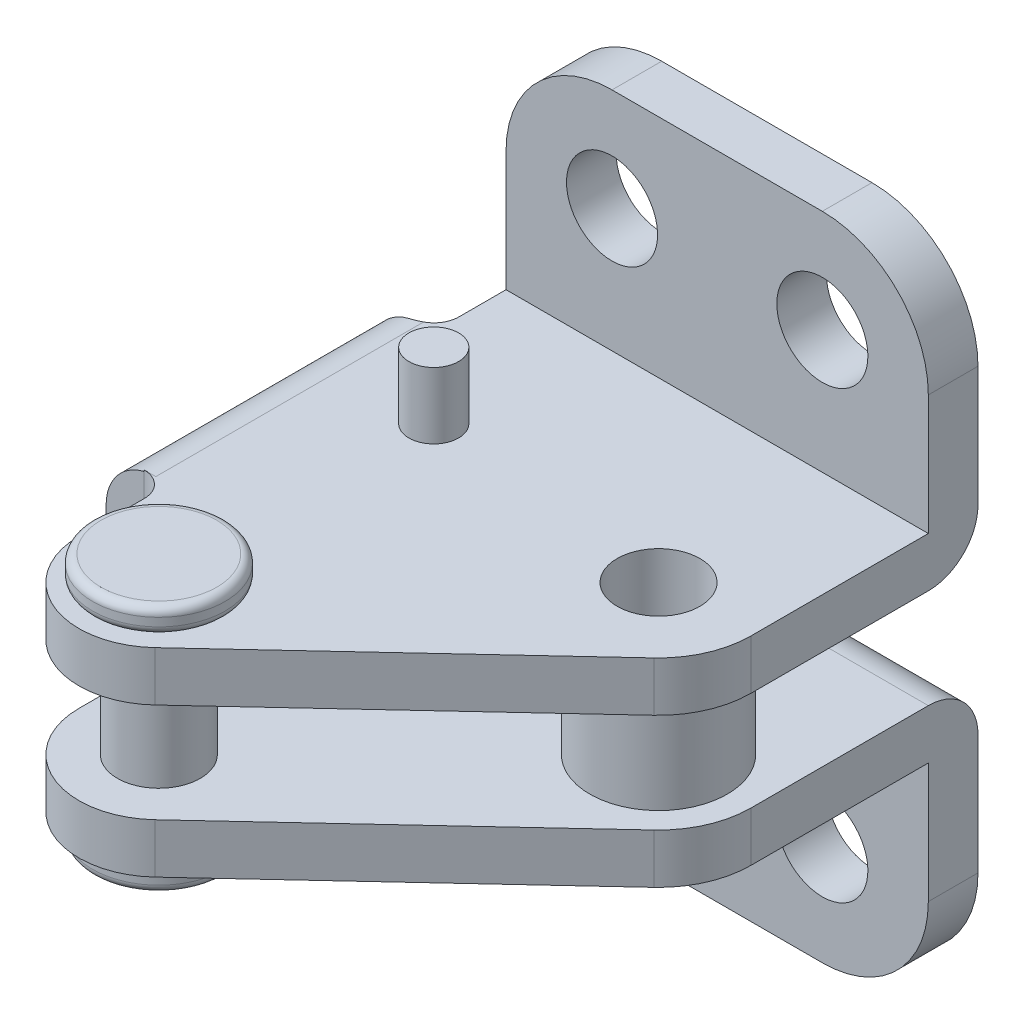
ISO-10303-21;
HEADER;
FILE_DESCRIPTION(('STEP AP214'),'2;1');
FILE_NAME('part.step','',(''),(''),'','','');
FILE_SCHEMA(('AUTOMOTIVE_DESIGN { 1 0 10303 214 1 1 1 1 }'));
ENDSEC;
DATA;
#1=APPLICATION_CONTEXT('core data for automotive mechanical design processes');
#2=APPLICATION_PROTOCOL_DEFINITION('international standard','automotive_design',2000,#1);
#3=PRODUCT_CONTEXT('',#1,'mechanical');
#4=PRODUCT('Part','Part','',(#3));
#5=PRODUCT_RELATED_PRODUCT_CATEGORY('part','',(#4));
#6=PRODUCT_DEFINITION_FORMATION('','',#4);
#7=PRODUCT_DEFINITION_CONTEXT('part definition',#1,'design');
#8=PRODUCT_DEFINITION('design','',#6,#7);
#9=PRODUCT_DEFINITION_SHAPE('','',#8);
#10=(LENGTH_UNIT() NAMED_UNIT(*) SI_UNIT(.MILLI.,.METRE.));
#11=(NAMED_UNIT(*) PLANE_ANGLE_UNIT() SI_UNIT($,.RADIAN.));
#12=(NAMED_UNIT(*) SI_UNIT($,.STERADIAN.) SOLID_ANGLE_UNIT());
#13=UNCERTAINTY_MEASURE_WITH_UNIT(LENGTH_MEASURE(1.E-05),#10,'distance_accuracy_value','');
#14=(GEOMETRIC_REPRESENTATION_CONTEXT(3) GLOBAL_UNCERTAINTY_ASSIGNED_CONTEXT((#13)) GLOBAL_UNIT_ASSIGNED_CONTEXT((#10,
#11,#12)) REPRESENTATION_CONTEXT('',''));
#15=CARTESIAN_POINT('',(0.,0.,0.));
#16=DIRECTION('',(0.,0.,1.));
#17=DIRECTION('',(1.,0.,0.));
#18=AXIS2_PLACEMENT_3D('',#15,#16,#17);
#19=CARTESIAN_POINT('',(-1.57560000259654,5.942,28.78965945));
#20=DIRECTION('',(0.,1.,0.));
#21=DIRECTION('',(-1.,0.,0.));
#22=AXIS2_PLACEMENT_3D('',#19,#20,#21);
#23=PLANE('',#22);
#24=CARTESIAN_POINT('',(-1.57560000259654,5.94199999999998,28.78965945));
#25=DIRECTION('',(0.,1.,0.));
#26=DIRECTION('',(1.,0.,0.));
#27=AXIS2_PLACEMENT_3D('',#24,#25,#26);
#28=CIRCLE('',#27,3.5);
#29=CARTESIAN_POINT('',(1.92439999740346,5.942,28.78965945));
#30=VERTEX_POINT('',#29);
#31=CARTESIAN_POINT('',(-5.07560000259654,5.942,28.78965945));
#32=VERTEX_POINT('',#31);
#33=EDGE_CURVE('E442',#30,#32,#28,.T.);
#34=ORIENTED_EDGE('',*,*,#33,.F.);
#35=CARTESIAN_POINT('',(-1.57560000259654,5.94199999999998,28.78965945));
#36=DIRECTION('',(0.,1.,0.));
#37=DIRECTION('',(-1.,0.,0.));
#38=AXIS2_PLACEMENT_3D('',#35,#36,#37);
#39=CIRCLE('',#38,3.5);
#40=EDGE_CURVE('E452',#32,#30,#39,.T.);
#41=ORIENTED_EDGE('',*,*,#40,.F.);
#42=EDGE_LOOP('',(#34,#41));
#43=FACE_BOUND('',#42,.T.);
#44=ADVANCED_FACE('F14',(#43),#23,.F.);
#45=CARTESIAN_POINT('',(-1.57560000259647,20.95,28.78965945));
#46=DIRECTION('',(0.,-1.,0.));
#47=DIRECTION('',(1.,0.,0.));
#48=AXIS2_PLACEMENT_3D('',#45,#46,#47);
#49=PLANE('',#48);
#50=CARTESIAN_POINT('',(-1.57560000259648,20.95,28.78965945));
#51=DIRECTION('',(0.,-1.,0.));
#52=DIRECTION('',(-1.,0.,0.));
#53=AXIS2_PLACEMENT_3D('',#50,#51,#52);
#54=CIRCLE('',#53,3.49999999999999);
#55=CARTESIAN_POINT('',(-5.07560000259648,20.95,28.78965945));
#56=VERTEX_POINT('',#55);
#57=CARTESIAN_POINT('',(1.92439999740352,20.95,28.78965945));
#58=VERTEX_POINT('',#57);
#59=EDGE_CURVE('E408',#56,#58,#54,.T.);
#60=ORIENTED_EDGE('',*,*,#59,.F.);
#61=CARTESIAN_POINT('',(-1.57560000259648,20.95,28.78965945));
#62=DIRECTION('',(0.,-1.,0.));
#63=DIRECTION('',(1.,0.,0.));
#64=AXIS2_PLACEMENT_3D('',#61,#62,#63);
#65=CIRCLE('',#64,3.49999999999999);
#66=EDGE_CURVE('E378',#58,#56,#65,.T.);
#67=ORIENTED_EDGE('',*,*,#66,.F.);
#68=EDGE_LOOP('',(#60,#67));
#69=FACE_BOUND('',#68,.T.);
#70=ADVANCED_FACE('F413',(#69),#49,.F.);
#71=CARTESIAN_POINT('',(-1.57560000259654,6.44199999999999,28.78965945));
#72=DIRECTION('',(0.,1.,0.));
#73=DIRECTION('',(-1.,0.,0.));
#74=AXIS2_PLACEMENT_3D('',#71,#72,#73);
#75=TOROIDAL_SURFACE('',#74,3.5,0.5);
#76=ORIENTED_EDGE('',*,*,#40,.T.);
#77=ORIENTED_EDGE('',*,*,#33,.T.);
#78=EDGE_LOOP('',(#76,#77));
#79=FACE_BOUND('',#78,.T.);
#80=CARTESIAN_POINT('',(-1.57560000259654,6.442,28.78965945));
#81=DIRECTION('',(0.,-1.,0.));
#82=DIRECTION('',(1.,0.,0.));
#83=AXIS2_PLACEMENT_3D('',#80,#81,#82);
#84=CIRCLE('',#83,4.);
#85=CARTESIAN_POINT('',(2.42439999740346,6.44199999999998,28.78965945));
#86=VERTEX_POINT('',#85);
#87=EDGE_CURVE('E402',#86,#86,#84,.F.);
#88=ORIENTED_EDGE('',*,*,#87,.F.);
#89=EDGE_LOOP('',(#88));
#90=FACE_BOUND('',#89,.T.);
#91=ADVANCED_FACE('F394',(#79,#90),#75,.T.);
#92=CARTESIAN_POINT('',(-1.57560000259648,20.45,28.78965945));
#93=DIRECTION('',(0.,-1.,0.));
#94=DIRECTION('',(1.,0.,0.));
#95=AXIS2_PLACEMENT_3D('',#92,#93,#94);
#96=TOROIDAL_SURFACE('',#95,3.5,0.500000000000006);
#97=ORIENTED_EDGE('',*,*,#66,.T.);
#98=ORIENTED_EDGE('',*,*,#59,.T.);
#99=EDGE_LOOP('',(#97,#98));
#100=FACE_BOUND('',#99,.T.);
#101=CARTESIAN_POINT('',(-1.57560000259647,20.45,28.78965945));
#102=DIRECTION('',(0.,1.,0.));
#103=DIRECTION('',(-1.,0.,0.));
#104=AXIS2_PLACEMENT_3D('',#101,#102,#103);
#105=CIRCLE('',#104,4.);
#106=CARTESIAN_POINT('',(-5.57560000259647,20.45,28.78965945));
#107=VERTEX_POINT('',#106);
#108=EDGE_CURVE('E1080',#107,#107,#105,.F.);
#109=ORIENTED_EDGE('',*,*,#108,.F.);
#110=EDGE_LOOP('',(#109));
#111=FACE_BOUND('',#110,.T.);
#112=ADVANCED_FACE('F383',(#100,#111),#96,.T.);
#113=CARTESIAN_POINT('',(-1.57560000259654,7.442,28.78965945));
#114=DIRECTION('',(0.,-1.,0.));
#115=DIRECTION('',(1.,0.,0.));
#116=AXIS2_PLACEMENT_3D('',#113,#114,#115);
#117=CYLINDRICAL_SURFACE('',#116,4.);
#118=CARTESIAN_POINT('',(-1.57560000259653,6.942,28.78965945));
#119=DIRECTION('',(0.,1.,0.));
#120=DIRECTION('',(-1.,0.,0.));
#121=AXIS2_PLACEMENT_3D('',#118,#119,#120);
#122=CIRCLE('',#121,4.);
#123=CARTESIAN_POINT('',(-5.57560000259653,6.94200000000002,28.78965945));
#124=VERTEX_POINT('',#123);
#125=EDGE_CURVE('E1091',#124,#124,#122,.T.);
#126=ORIENTED_EDGE('',*,*,#125,.F.);
#127=EDGE_LOOP('',(#126));
#128=FACE_BOUND('',#127,.T.);
#129=ORIENTED_EDGE('',*,*,#87,.T.);
#130=EDGE_LOOP('',(#129));
#131=FACE_BOUND('',#130,.T.);
#132=ADVANCED_FACE('F393',(#128,#131),#117,.T.);
#133=CARTESIAN_POINT('',(-1.57560000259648,19.45,28.78965945));
#134=DIRECTION('',(0.,1.,0.));
#135=DIRECTION('',(-1.,0.,0.));
#136=AXIS2_PLACEMENT_3D('',#133,#134,#135);
#137=CYLINDRICAL_SURFACE('',#136,4.);
#138=CARTESIAN_POINT('',(-1.57560000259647,19.95,28.78965945));
#139=DIRECTION('',(0.,-1.,0.));
#140=DIRECTION('',(1.,0.,0.));
#141=AXIS2_PLACEMENT_3D('',#138,#139,#140);
#142=CIRCLE('',#141,4.);
#143=CARTESIAN_POINT('',(2.42439999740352,19.95,28.78965945));
#144=VERTEX_POINT('',#143);
#145=EDGE_CURVE('E1088',#144,#144,#142,.T.);
#146=ORIENTED_EDGE('',*,*,#145,.F.);
#147=EDGE_LOOP('',(#146));
#148=FACE_BOUND('',#147,.T.);
#149=ORIENTED_EDGE('',*,*,#108,.T.);
#150=EDGE_LOOP('',(#149));
#151=FACE_BOUND('',#150,.T.);
#152=ADVANCED_FACE('F1170',(#148,#151),#137,.T.);
#153=CARTESIAN_POINT('',(-1.57560000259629,23.45,12.18965945));
#154=DIRECTION('',(0.,1.,0.));
#155=DIRECTION('',(-1.,0.,0.));
#156=AXIS2_PLACEMENT_3D('',#153,#154,#155);
#157=PLANE('',#156);
#158=CARTESIAN_POINT('',(-1.57560000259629,23.45,12.18965945));
#159=DIRECTION('',(0.,-1.,0.));
#160=DIRECTION('',(1.,0.,0.));
#161=AXIS2_PLACEMENT_3D('',#158,#159,#160);
#162=CIRCLE('',#161,1.5);
#163=CARTESIAN_POINT('',(-0.0756000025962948,23.45,12.18965945));
#164=VERTEX_POINT('',#163);
#165=EDGE_CURVE('E309',#164,#164,#162,.T.);
#166=ORIENTED_EDGE('',*,*,#165,.F.);
#167=EDGE_LOOP('',(#166));
#168=FACE_BOUND('',#167,.T.);
#169=ADVANCED_FACE('F1168',(#168),#157,.T.);
#170=CARTESIAN_POINT('',(-9.99968944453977E-09,26.6984000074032,0.));
#171=DIRECTION('',(0.,0.,1.));
#172=DIRECTION('',(0.,-1.,0.));
#173=AXIS2_PLACEMENT_3D('',#170,#171,#172);
#174=CYLINDRICAL_SURFACE('',#173,6.40159999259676);
#175=CARTESIAN_POINT('',(-9.99968944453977E-09,26.6984000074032,0.));
#176=DIRECTION('',(0.,0.,1.));
#177=DIRECTION('',(0.,-1.,0.));
#178=AXIS2_PLACEMENT_3D('',#175,#176,#177);
#179=CIRCLE('',#178,6.40159999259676);
#180=CARTESIAN_POINT('',(-6.40160000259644,26.6984000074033,0.));
#181=VERTEX_POINT('',#180);
#182=CARTESIAN_POINT('',(-9.99967946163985E-09,33.1,0.));
#183=VERTEX_POINT('',#182);
#184=EDGE_CURVE('E280',#181,#183,#179,.F.);
#185=ORIENTED_EDGE('',*,*,#184,.F.);
#186=DIRECTION('',(0.,0.,1.));
#187=VECTOR('',#186,1.);
#188=CARTESIAN_POINT('',(-6.40160000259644,26.6984000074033,0.));
#189=LINE('',#188,#187);
#190=CARTESIAN_POINT('',(-6.40160000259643,26.6984000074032,3.));
#191=VERTEX_POINT('',#190);
#192=EDGE_CURVE('E284',#181,#191,#189,.T.);
#193=ORIENTED_EDGE('',*,*,#192,.T.);
#194=CARTESIAN_POINT('',(-9.99968911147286E-09,26.6984000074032,3.));
#195=DIRECTION('',(0.,0.,1.));
#196=DIRECTION('',(0.,-1.,0.));
#197=AXIS2_PLACEMENT_3D('',#194,#195,#196);
#198=CIRCLE('',#197,6.40159999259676);
#199=CARTESIAN_POINT('',(-9.99967929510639E-09,33.1,3.));
#200=VERTEX_POINT('',#199);
#201=EDGE_CURVE('E779',#191,#200,#198,.F.);
#202=ORIENTED_EDGE('',*,*,#201,.T.);
#203=DIRECTION('',(0.,0.,1.));
#204=VECTOR('',#203,1.);
#205=CARTESIAN_POINT('',(-9.99967119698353E-09,33.1,0.));
#206=LINE('',#205,#204);
#207=EDGE_CURVE('E286',#200,#183,#206,.F.);
#208=ORIENTED_EDGE('',*,*,#207,.T.);
#209=EDGE_LOOP('',(#185,#193,#202,#208));
#210=FACE_BOUND('',#209,.T.);
#211=ADVANCED_FACE('F282',(#210),#174,.T.);
#212=CARTESIAN_POINT('',(-9.99961745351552E-09,33.1,0.));
#213=DIRECTION('',(0.,-1.,0.));
#214=DIRECTION('',(1.,0.,0.));
#215=AXIS2_PLACEMENT_3D('',#212,#213,#214);
#216=PLANE('',#215);
#217=ORIENTED_EDGE('',*,*,#207,.F.);
#218=DIRECTION('',(1.,0.,0.));
#219=VECTOR('',#218,1.);
#220=CARTESIAN_POINT('',(-36.0015869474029,33.1,3.));
#221=LINE('',#220,#219);
#222=CARTESIAN_POINT('',(12.6983999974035,33.1,3.));
#223=VERTEX_POINT('',#222);
#224=EDGE_CURVE('E775',#200,#223,#221,.T.);
#225=ORIENTED_EDGE('',*,*,#224,.T.);
#226=DIRECTION('',(0.,0.,1.));
#227=VECTOR('',#226,1.);
#228=CARTESIAN_POINT('',(12.6983999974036,33.1,0.));
#229=LINE('',#228,#227);
#230=CARTESIAN_POINT('',(12.6983999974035,33.1,0.));
#231=VERTEX_POINT('',#230);
#232=EDGE_CURVE('E1078',#231,#223,#229,.T.);
#233=ORIENTED_EDGE('',*,*,#232,.F.);
#234=DIRECTION('',(1.,0.,0.));
#235=VECTOR('',#234,1.);
#236=CARTESIAN_POINT('',(-36.0015869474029,33.1,0.));
#237=LINE('',#236,#235);
#238=EDGE_CURVE('E290',#183,#231,#237,.T.);
#239=ORIENTED_EDGE('',*,*,#238,.F.);
#240=EDGE_LOOP('',(#217,#225,#233,#239));
#241=FACE_BOUND('',#240,.T.);
#242=ADVANCED_FACE('F1077',(#241),#216,.F.);
#243=CARTESIAN_POINT('',(-9.99968684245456E-09,26.9,0.));
#244=DIRECTION('',(0.,0.,1.));
#245=DIRECTION('',(0.,-1.,0.));
#246=AXIS2_PLACEMENT_3D('',#243,#244,#245);
#247=CYLINDRICAL_SURFACE('',#246,2.75);
#248=CARTESIAN_POINT('',(-9.99968684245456E-09,26.9,0.));
#249=DIRECTION('',(0.,0.,1.));
#250=DIRECTION('',(0.,-1.,0.));
#251=AXIS2_PLACEMENT_3D('',#248,#249,#250);
#252=CIRCLE('',#251,2.75);
#253=CARTESIAN_POINT('',(-9.99968684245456E-09,24.15,0.));
#254=VERTEX_POINT('',#253);
#255=EDGE_CURVE('E291',#254,#254,#252,.T.);
#256=ORIENTED_EDGE('',*,*,#255,.F.);
#257=EDGE_LOOP('',(#256));
#258=FACE_BOUND('',#257,.T.);
#259=CARTESIAN_POINT('',(-9.99968650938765E-09,26.9,3.));
#260=DIRECTION('',(0.,0.,1.));
#261=DIRECTION('',(0.,-1.,0.));
#262=AXIS2_PLACEMENT_3D('',#259,#260,#261);
#263=CIRCLE('',#262,2.75);
#264=CARTESIAN_POINT('',(-9.99968650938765E-09,24.15,2.99999999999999));
#265=VERTEX_POINT('',#264);
#266=EDGE_CURVE('E1119',#265,#265,#263,.T.);
#267=ORIENTED_EDGE('',*,*,#266,.T.);
#268=EDGE_LOOP('',(#267));
#269=FACE_BOUND('',#268,.T.);
#270=ADVANCED_FACE('F1136',(#258,#269),#247,.F.);
#271=CARTESIAN_POINT('',(12.6999999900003,26.9,0.));
#272=DIRECTION('',(0.,0.,1.));
#273=DIRECTION('',(0.,-1.,0.));
#274=AXIS2_PLACEMENT_3D('',#271,#272,#273);
#275=CYLINDRICAL_SURFACE('',#274,2.75);
#276=CARTESIAN_POINT('',(12.6999999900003,26.9,0.));
#277=DIRECTION('',(0.,0.,1.));
#278=DIRECTION('',(0.,-1.,0.));
#279=AXIS2_PLACEMENT_3D('',#276,#277,#278);
#280=CIRCLE('',#279,2.75);
#281=CARTESIAN_POINT('',(12.6999999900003,24.15,0.));
#282=VERTEX_POINT('',#281);
#283=EDGE_CURVE('E1082',#282,#282,#280,.T.);
#284=ORIENTED_EDGE('',*,*,#283,.F.);
#285=EDGE_LOOP('',(#284));
#286=FACE_BOUND('',#285,.T.);
#287=CARTESIAN_POINT('',(12.6999999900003,26.9,3.));
#288=DIRECTION('',(0.,0.,1.));
#289=DIRECTION('',(0.,-1.,0.));
#290=AXIS2_PLACEMENT_3D('',#287,#288,#289);
#291=CIRCLE('',#290,2.75);
#292=CARTESIAN_POINT('',(12.6999999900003,24.15,2.99999999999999));
#293=VERTEX_POINT('',#292);
#294=EDGE_CURVE('E768',#293,#293,#291,.T.);
#295=ORIENTED_EDGE('',*,*,#294,.T.);
#296=EDGE_LOOP('',(#295));
#297=FACE_BOUND('',#296,.T.);
#298=ADVANCED_FACE('F1133',(#286,#297),#275,.F.);
#299=CARTESIAN_POINT('',(12.6983999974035,26.6984000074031,0.));
#300=DIRECTION('',(0.,0.,1.));
#301=DIRECTION('',(0.,-1.,0.));
#302=AXIS2_PLACEMENT_3D('',#299,#300,#301);
#303=CYLINDRICAL_SURFACE('',#302,6.40159999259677);
#304=CARTESIAN_POINT('',(12.6983999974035,26.6984000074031,0.));
#305=DIRECTION('',(0.,0.,1.));
#306=DIRECTION('',(0.,-1.,0.));
#307=AXIS2_PLACEMENT_3D('',#304,#305,#306);
#308=CIRCLE('',#307,6.40159999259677);
#309=CARTESIAN_POINT('',(19.0999999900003,26.698400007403,0.));
#310=VERTEX_POINT('',#309);
#311=EDGE_CURVE('E1116',#231,#310,#308,.F.);
#312=ORIENTED_EDGE('',*,*,#311,.F.);
#313=ORIENTED_EDGE('',*,*,#232,.T.);
#314=CARTESIAN_POINT('',(12.6983999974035,26.6984000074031,3.));
#315=DIRECTION('',(0.,0.,1.));
#316=DIRECTION('',(0.,-1.,0.));
#317=AXIS2_PLACEMENT_3D('',#314,#315,#316);
#318=CIRCLE('',#317,6.40159999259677);
#319=CARTESIAN_POINT('',(19.0999999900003,26.698400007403,3.));
#320=VERTEX_POINT('',#319);
#321=EDGE_CURVE('E778',#223,#320,#318,.F.);
#322=ORIENTED_EDGE('',*,*,#321,.T.);
#323=DIRECTION('',(0.,0.,1.));
#324=VECTOR('',#323,1.);
#325=CARTESIAN_POINT('',(19.0999999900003,26.698400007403,0.));
#326=LINE('',#325,#324);
#327=EDGE_CURVE('E764',#320,#310,#326,.F.);
#328=ORIENTED_EDGE('',*,*,#327,.T.);
#329=EDGE_LOOP('',(#312,#313,#322,#328));
#330=FACE_BOUND('',#329,.T.);
#331=ADVANCED_FACE('F1118',(#330),#303,.T.);
#332=CARTESIAN_POINT('',(-36.0015869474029,26.6984000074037,0.));
#333=DIRECTION('',(0.,0.,-1.));
#334=DIRECTION('',(0.,1.,0.));
#335=AXIS2_PLACEMENT_3D('',#332,#333,#334);
#336=PLANE('',#335);
#337=DIRECTION('',(0.,-1.,0.));
#338=VECTOR('',#337,1.);
#339=CARTESIAN_POINT('',(19.0999999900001,8.24794054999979,0.));
#340=LINE('',#339,#338);
#341=CARTESIAN_POINT('',(19.0999999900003,19.4499999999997,0.));
#342=VERTEX_POINT('',#341);
#343=EDGE_CURVE('E762',#310,#342,#340,.T.);
#344=ORIENTED_EDGE('',*,*,#343,.T.);
#345=DIRECTION('',(-1.,0.,0.));
#346=VECTOR('',#345,1.);
#347=CARTESIAN_POINT('',(-6.40160000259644,19.45,0.));
#348=LINE('',#347,#346);
#349=CARTESIAN_POINT('',(-6.40160000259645,19.45,0.));
#350=VERTEX_POINT('',#349);
#351=EDGE_CURVE('E306',#350,#342,#348,.F.);
#352=ORIENTED_EDGE('',*,*,#351,.F.);
#353=DIRECTION('',(0.,1.,0.));
#354=VECTOR('',#353,1.);
#355=CARTESIAN_POINT('',(-6.40160000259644,26.6984000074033,0.));
#356=LINE('',#355,#354);
#357=EDGE_CURVE('E297',#350,#181,#356,.T.);
#358=ORIENTED_EDGE('',*,*,#357,.T.);
#359=ORIENTED_EDGE('',*,*,#184,.T.);
#360=ORIENTED_EDGE('',*,*,#238,.T.);
#361=ORIENTED_EDGE('',*,*,#311,.T.);
#362=EDGE_LOOP('',(#344,#352,#358,#359,#360,#361));
#363=FACE_BOUND('',#362,.T.);
#364=ORIENTED_EDGE('',*,*,#255,.T.);
#365=EDGE_LOOP('',(#364));
#366=FACE_BOUND('',#365,.T.);
#367=ORIENTED_EDGE('',*,*,#283,.T.);
#368=EDGE_LOOP('',(#367));
#369=FACE_BOUND('',#368,.T.);
#370=ADVANCED_FACE('F304',(#363,#366,#369),#336,.T.);
#371=CARTESIAN_POINT('',(-6.40160000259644,19.45,3.));
#372=DIRECTION('',(-1.,0.,0.));
#373=DIRECTION('',(0.,-1.,0.));
#374=AXIS2_PLACEMENT_3D('',#371,#372,#373);
#375=CYLINDRICAL_SURFACE('',#374,3.);
#376=CARTESIAN_POINT('',(19.0999999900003,19.4499999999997,3.));
#377=DIRECTION('',(-1.,0.,0.));
#378=DIRECTION('',(0.,-1.,0.));
#379=AXIS2_PLACEMENT_3D('',#376,#377,#378);
#380=CIRCLE('',#379,3.);
#381=CARTESIAN_POINT('',(19.0999999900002,16.4499999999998,3.));
#382=VERTEX_POINT('',#381);
#383=EDGE_CURVE('E761',#342,#382,#380,.T.);
#384=ORIENTED_EDGE('',*,*,#383,.T.);
#385=DIRECTION('',(1.,0.,0.));
#386=VECTOR('',#385,1.);
#387=CARTESIAN_POINT('',(-36.001586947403,16.4500000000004,3.));
#388=LINE('',#387,#386);
#389=CARTESIAN_POINT('',(-6.40160000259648,16.45,3.));
#390=VERTEX_POINT('',#389);
#391=EDGE_CURVE('E789',#390,#382,#388,.T.);
#392=ORIENTED_EDGE('',*,*,#391,.F.);
#393=CARTESIAN_POINT('',(-6.40160000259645,19.45,3.));
#394=DIRECTION('',(-1.,0.,0.));
#395=DIRECTION('',(0.,-1.,0.));
#396=AXIS2_PLACEMENT_3D('',#393,#394,#395);
#397=CIRCLE('',#396,3.);
#398=EDGE_CURVE('E307',#390,#350,#397,.F.);
#399=ORIENTED_EDGE('',*,*,#398,.T.);
#400=ORIENTED_EDGE('',*,*,#351,.T.);
#401=EDGE_LOOP('',(#384,#392,#399,#400));
#402=FACE_BOUND('',#401,.T.);
#403=ADVANCED_FACE('F1148',(#402),#375,.T.);
#404=CARTESIAN_POINT('',(-36.001586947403,16.4500000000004,-4.7484000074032));
#405=DIRECTION('',(0.,-1.,0.));
#406=DIRECTION('',(1.,0.,0.));
#407=AXIS2_PLACEMENT_3D('',#404,#405,#406);
#408=PLANE('',#407);
#409=CARTESIAN_POINT('',(13.5120000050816,16.45,13.70205945));
#410=DIRECTION('',(0.,1.,0.));
#411=DIRECTION('',(-1.,0.,0.));
#412=AXIS2_PLACEMENT_3D('',#409,#410,#411);
#413=CIRCLE('',#412,4.15);
#414=CARTESIAN_POINT('',(9.36200000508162,16.45,13.70205945));
#415=VERTEX_POINT('',#414);
#416=EDGE_CURVE('E808',#415,#415,#413,.F.);
#417=ORIENTED_EDGE('',*,*,#416,.F.);
#418=EDGE_LOOP('',(#417));
#419=FACE_BOUND('',#418,.T.);
#420=CARTESIAN_POINT('',(-1.57560000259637,16.45,12.18965945));
#421=DIRECTION('',(0.,-1.,0.));
#422=DIRECTION('',(1.,0.,0.));
#423=AXIS2_PLACEMENT_3D('',#420,#421,#422);
#424=CIRCLE('',#423,1.5);
#425=CARTESIAN_POINT('',(-0.0756000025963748,16.45,12.18965945));
#426=VERTEX_POINT('',#425);
#427=EDGE_CURVE('E731',#426,#426,#424,.T.);
#428=ORIENTED_EDGE('',*,*,#427,.F.);
#429=EDGE_LOOP('',(#428));
#430=FACE_BOUND('',#429,.T.);
#431=CARTESIAN_POINT('',(-7.90160000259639,16.45,24.85));
#432=DIRECTION('',(0.,1.,0.));
#433=DIRECTION('',(-1.,0.,0.));
#434=AXIS2_PLACEMENT_3D('',#431,#432,#433);
#435=CIRCLE('',#434,1.49999999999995);
#436=CARTESIAN_POINT('',(-6.40160000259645,16.45,24.85));
#437=VERTEX_POINT('',#436);
#438=CARTESIAN_POINT('',(-7.90160000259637,16.45,23.35));
#439=VERTEX_POINT('',#438);
#440=EDGE_CURVE('E743',#437,#439,#435,.T.);
#441=ORIENTED_EDGE('',*,*,#440,.T.);
#442=DIRECTION('',(1.,0.,0.));
#443=VECTOR('',#442,1.);
#444=CARTESIAN_POINT('',(-36.001586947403,16.4500000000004,23.35));
#445=LINE('',#444,#443);
#446=CARTESIAN_POINT('',(-8.15159346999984,16.45,23.35));
#447=VERTEX_POINT('',#446);
#448=EDGE_CURVE('E1095',#439,#447,#445,.F.);
#449=ORIENTED_EDGE('',*,*,#448,.T.);
#450=DIRECTION('',(0.,0.,1.));
#451=VECTOR('',#450,1.);
#452=CARTESIAN_POINT('',(-8.15159346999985,16.45,-4.7484000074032));
#453=LINE('',#452,#451);
#454=CARTESIAN_POINT('',(-8.15159346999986,16.45,7.3500000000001));
#455=VERTEX_POINT('',#454);
#456=EDGE_CURVE('E728',#455,#447,#453,.T.);
#457=ORIENTED_EDGE('',*,*,#456,.F.);
#458=DIRECTION('',(1.,0.,0.));
#459=VECTOR('',#458,1.);
#460=CARTESIAN_POINT('',(-36.001586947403,16.4500000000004,7.3500000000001));
#461=LINE('',#460,#459);
#462=CARTESIAN_POINT('',(-7.90160000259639,16.45,7.3500000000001));
#463=VERTEX_POINT('',#462);
#464=EDGE_CURVE('E1101',#455,#463,#461,.T.);
#465=ORIENTED_EDGE('',*,*,#464,.T.);
#466=CARTESIAN_POINT('',(-7.90160000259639,16.45,5.85000000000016));
#467=DIRECTION('',(0.,1.,0.));
#468=DIRECTION('',(-1.,0.,0.));
#469=AXIS2_PLACEMENT_3D('',#466,#467,#468);
#470=CIRCLE('',#469,1.49999999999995);
#471=CARTESIAN_POINT('',(-6.40160000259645,16.45,5.85000000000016));
#472=VERTEX_POINT('',#471);
#473=EDGE_CURVE('E317',#463,#472,#470,.T.);
#474=ORIENTED_EDGE('',*,*,#473,.T.);
#475=DIRECTION('',(0.,0.,1.));
#476=VECTOR('',#475,1.);
#477=CARTESIAN_POINT('',(-6.40160000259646,16.45,0.));
#478=LINE('',#477,#476);
#479=EDGE_CURVE('E301',#472,#390,#478,.F.);
#480=ORIENTED_EDGE('',*,*,#479,.T.);
#481=ORIENTED_EDGE('',*,*,#391,.T.);
#482=DIRECTION('',(0.,0.,1.));
#483=VECTOR('',#482,1.);
#484=CARTESIAN_POINT('',(19.0999999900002,16.45,0.));
#485=LINE('',#484,#483);
#486=CARTESIAN_POINT('',(19.0999999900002,16.45,13.70205945));
#487=VERTEX_POINT('',#486);
#488=EDGE_CURVE('E758',#382,#487,#485,.T.);
#489=ORIENTED_EDGE('',*,*,#488,.T.);
#490=CARTESIAN_POINT('',(13.5119999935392,16.45,13.70205945));
#491=DIRECTION('',(0.,1.,0.));
#492=DIRECTION('',(-1.,0.,0.));
#493=AXIS2_PLACEMENT_3D('',#490,#491,#492);
#494=CIRCLE('',#493,5.58799999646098);
#495=CARTESIAN_POINT('',(17.319681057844,16.45,17.7919627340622));
#496=VERTEX_POINT('',#495);
#497=EDGE_CURVE('E757',#496,#487,#494,.T.);
#498=ORIENTED_EDGE('',*,*,#497,.F.);
#499=DIRECTION('',(-0.731908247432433,0.,0.681403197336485));
#500=VECTOR('',#499,1.);
#501=CARTESIAN_POINT('',(1.71285182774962,16.45,32.3218486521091));
#502=LINE('',#501,#500);
#503=CARTESIAN_POINT('',(1.71285182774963,16.45,32.3218486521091));
#504=VERTEX_POINT('',#503);
#505=EDGE_CURVE('E754',#496,#504,#502,.T.);
#506=ORIENTED_EDGE('',*,*,#505,.T.);
#507=CARTESIAN_POINT('',(-1.57560000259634,16.45,28.78965945));
#508=DIRECTION('',(0.,1.,0.));
#509=DIRECTION('',(-1.,0.,0.));
#510=AXIS2_PLACEMENT_3D('',#507,#508,#509);
#511=CIRCLE('',#510,4.82600000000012);
#512=CARTESIAN_POINT('',(-6.40160000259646,16.45,28.78965945));
#513=VERTEX_POINT('',#512);
#514=EDGE_CURVE('E750',#513,#504,#511,.T.);
#515=ORIENTED_EDGE('',*,*,#514,.F.);
#516=DIRECTION('',(0.,0.,1.));
#517=VECTOR('',#516,1.);
#518=CARTESIAN_POINT('',(-6.40160000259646,16.45,24.85));
#519=LINE('',#518,#517);
#520=EDGE_CURVE('E747',#513,#437,#519,.F.);
#521=ORIENTED_EDGE('',*,*,#520,.T.);
#522=EDGE_LOOP('',(#441,#449,#457,#465,#474,#480,#481,#489,#498,#506,#515,#521));
#523=FACE_BOUND('',#522,.T.);
#524=CARTESIAN_POINT('',(-1.5756000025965,16.45,28.78965945));
#525=DIRECTION('',(0.,1.,0.));
#526=DIRECTION('',(-1.,0.,0.));
#527=AXIS2_PLACEMENT_3D('',#524,#525,#526);
#528=CIRCLE('',#527,2.5);
#529=CARTESIAN_POINT('',(-4.0756000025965,16.45,28.78965945));
#530=VERTEX_POINT('',#529);
#531=EDGE_CURVE('E732',#530,#530,#528,.F.);
#532=ORIENTED_EDGE('',*,*,#531,.F.);
#533=EDGE_LOOP('',(#532));
#534=FACE_BOUND('',#533,.T.);
#535=ADVANCED_FACE('F786',(#419,#430,#523,#534),#408,.T.);
#536=CARTESIAN_POINT('',(-1.57560000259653,6.94199999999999,28.78965945));
#537=DIRECTION('',(0.,1.,0.));
#538=DIRECTION('',(-1.,0.,0.));
#539=AXIS2_PLACEMENT_3D('',#536,#537,#538);
#540=TOROIDAL_SURFACE('',#539,3.5,0.500000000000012);
#541=ORIENTED_EDGE('',*,*,#125,.T.);
#542=EDGE_LOOP('',(#541));
#543=FACE_BOUND('',#542,.T.);
#544=CARTESIAN_POINT('',(-5.07623473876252,7.44199959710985,28.7896594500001));
#545=CARTESIAN_POINT('',(-5.07622836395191,7.44199960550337,28.7516001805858));
#546=CARTESIAN_POINT('',(-5.07560084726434,7.44199961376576,28.7135410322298));
#547=CARTESIAN_POINT('',(-5.07310523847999,7.44199963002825,28.6374636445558));
#548=CARTESIAN_POINT('',(-5.07123715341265,7.44199963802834,28.5994454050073));
#549=CARTESIAN_POINT('',(-5.06626213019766,7.44199965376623,28.5234902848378));
#550=CARTESIAN_POINT('',(-5.06315519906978,7.44199966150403,28.4855534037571));
#551=CARTESIAN_POINT('',(-5.05570587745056,7.44199967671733,28.4098013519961));
#552=CARTESIAN_POINT('',(-5.05136349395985,7.44199968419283,28.3719861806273));
#553=CARTESIAN_POINT('',(-5.04144788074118,7.44199969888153,28.2965177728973));
#554=CARTESIAN_POINT('',(-5.0358746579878,7.44199970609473,28.2588645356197));
#555=CARTESIAN_POINT('',(-5.02350331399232,7.44199972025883,28.1837600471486));
#556=CARTESIAN_POINT('',(-5.01670519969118,7.44199972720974,28.1463087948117));
#557=CARTESIAN_POINT('',(-5.00189131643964,7.44199974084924,28.071648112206));
#558=CARTESIAN_POINT('',(-4.99387555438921,7.44199974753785,28.034438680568));
#559=CARTESIAN_POINT('',(-4.97663491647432,7.44199976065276,27.9603012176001));
#560=CARTESIAN_POINT('',(-4.96741004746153,7.44199976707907,27.9233731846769));
#561=CARTESIAN_POINT('',(-4.94776102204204,7.44199977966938,27.8498377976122));
#562=CARTESIAN_POINT('',(-4.9373368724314,7.44199978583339,27.8132304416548));
#563=CARTESIAN_POINT('',(-4.91530038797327,7.44199979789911,27.7403753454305));
#564=CARTESIAN_POINT('',(-4.90368805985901,7.44199980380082,27.704127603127));
#565=CARTESIAN_POINT('',(-4.87928758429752,7.44199981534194,27.6320302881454));
#566=CARTESIAN_POINT('',(-4.86649944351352,7.44199982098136,27.5961807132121));
#567=CARTESIAN_POINT('',(-4.83976095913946,7.44199983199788,27.5249178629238));
#568=CARTESIAN_POINT('',(-4.82581062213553,7.441999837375,27.4895045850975));
#569=CARTESIAN_POINT('',(-4.79676259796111,7.44199984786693,27.4191519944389));
#570=CARTESIAN_POINT('',(-4.78166491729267,7.44199985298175,27.384212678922));
#571=CARTESIAN_POINT('',(-4.75033827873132,7.44199986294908,27.3148451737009));
#572=CARTESIAN_POINT('',(-4.73410932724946,7.4419998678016,27.2804169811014));
#573=CARTESIAN_POINT('',(-4.70053742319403,7.44199987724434,27.2121083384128));
#574=CARTESIAN_POINT('',(-4.68319447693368,7.44199988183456,27.1782278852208));
#575=CARTESIAN_POINT('',(-4.64741304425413,7.4419998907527,27.1110507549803));
#576=CARTESIAN_POINT('',(-4.62897456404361,7.44199989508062,27.0777540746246));
#577=CARTESIAN_POINT('',(-4.59102168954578,7.44199990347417,27.0117799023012));
#578=CARTESIAN_POINT('',(-4.57150730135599,7.44199990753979,26.9791024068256));
#579=CARTESIAN_POINT('',(-4.53142338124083,7.44199991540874,26.9144013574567));
#580=CARTESIAN_POINT('',(-4.51085385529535,7.44199991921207,26.8823777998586));
#581=CARTESIAN_POINT('',(-4.46868155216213,7.44199992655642,26.8190186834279));
#582=CARTESIAN_POINT('',(-4.4470787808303,7.44199993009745,26.7876831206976));
#583=CARTESIAN_POINT('',(-4.40286297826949,7.4419999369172,26.7257333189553));
#584=CARTESIAN_POINT('',(-4.38024995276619,7.44199994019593,26.6951190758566));
#585=CARTESIAN_POINT('',(-4.33403770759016,7.4419999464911,26.6346444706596));
#586=CARTESIAN_POINT('',(-4.31043849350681,7.44199994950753,26.6047841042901));
#587=CARTESIAN_POINT('',(-4.26227898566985,7.44199995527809,26.5458490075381));
#588=CARTESIAN_POINT('',(-4.23771869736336,7.44199995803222,26.5167742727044));
#589=CARTESIAN_POINT('',(-4.18766317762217,7.44199996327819,26.4594413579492));
#590=CARTESIAN_POINT('',(-4.16216795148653,7.44199996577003,26.4311831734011));
#591=CARTESIAN_POINT('',(-4.11026968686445,7.4419999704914,26.3755134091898));
#592=CARTESIAN_POINT('',(-4.08386665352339,7.44199997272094,26.3481018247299));
#593=CARTESIAN_POINT('',(-4.03018087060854,7.44199997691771,26.2941544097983));
#594=CARTESIAN_POINT('',(-4.00289812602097,7.44199997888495,26.2676185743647));
#595=CARTESIAN_POINT('',(-3.94748195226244,7.44199998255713,26.2154508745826));
#596=CARTESIAN_POINT('',(-3.91934852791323,7.44199998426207,26.1898190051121));
#597=CARTESIAN_POINT('',(-3.86226093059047,7.44199998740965,26.1394864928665));
#598=CARTESIAN_POINT('',(-3.83330676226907,7.44199998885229,26.1147858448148));
#599=CARTESIAN_POINT('',(-3.77460848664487,7.44199999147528,26.0663420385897));
#600=CARTESIAN_POINT('',(-3.74486438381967,7.44199999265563,26.042598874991));
#601=CARTESIAN_POINT('',(-3.68461788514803,7.44199999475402,25.9960952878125));
#602=CARTESIAN_POINT('',(-3.6541154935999,7.44199999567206,25.9733348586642));
#603=CARTESIAN_POINT('',(-3.59238488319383,7.44199999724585,25.9288209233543));
#604=CARTESIAN_POINT('',(-3.56115666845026,7.4419999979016,25.907067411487));
#605=CARTESIAN_POINT('',(-3.49800759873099,7.4419999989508,25.8645905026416));
#606=CARTESIAN_POINT('',(-3.46608674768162,7.44199999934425,25.8438670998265));
#607=CARTESIAN_POINT('',(-3.40158651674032,7.44199999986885,25.8034722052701));
#608=CARTESIAN_POINT('',(-3.36900714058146,7.442,25.7838007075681));
#609=CARTESIAN_POINT('',(-3.33611546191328,7.442,25.7646660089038));
#610=B_SPLINE_CURVE_WITH_KNOTS('',3,(#544,#545,#546,#547,#548,#549,#550,#551,#552,#553,#554,
#555,#556,#557,#558,#559,#560,#561,#562,#563,#564,#565,#566,#567,#568,#569,#570,#571,#572,#573,
#574,#575,#576,#577,#578,#579,#580,#581,#582,#583,#584,#585,#586,#587,#588,#589,#590,#591,#592,
#593,#594,#595,#596,#597,#598,#599,#600,#601,#602,#603,#604,#605,#606,#607,#608,#609),
.UNSPECIFIED.,.F.,.F.,(4,2,2,2,2,2,2,2,2,2,2,2,2,2,2,2,2,2,2,2,2,2,2,2,2,2,2,2,2,2,2,2,4),(0.,
0.114172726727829,0.228344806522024,0.342516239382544,0.456687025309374,0.570857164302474,
0.685026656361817,0.799195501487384,0.913363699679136,1.02753125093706,1.14169815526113,
1.25586441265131,1.3700300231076,1.48419498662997,1.59835930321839,1.71252297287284,
1.82668599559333,1.94084837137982,2.05501010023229,2.16917118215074,2.28333161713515,
2.3974914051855,2.51165054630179,2.62580904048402,2.73996688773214,2.85412408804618,
2.96828064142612,3.08243654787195,3.19659180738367,3.31074641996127,3.42490038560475,
3.5390537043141,3.65320637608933),.UNSPECIFIED.);
#611=CARTESIAN_POINT('',(-3.33611504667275,7.442,25.7646657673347));
#612=VERTEX_POINT('',#611);
#613=CARTESIAN_POINT('',(-5.0762347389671,7.44199975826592,28.7896594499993));
#614=VERTEX_POINT('',#613);
#615=EDGE_CURVE('E671',#612,#614,#610,.F.);
#616=ORIENTED_EDGE('',*,*,#615,.F.);
#617=CARTESIAN_POINT('',(-3.33611546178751,7.442,25.7646660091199));
#618=CARTESIAN_POINT('',(-3.33611532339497,7.442,25.7646659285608));
#619=CARTESIAN_POINT('',(-3.33611518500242,7.442,25.7646658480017));
#620=CARTESIAN_POINT('',(-3.33611497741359,7.442,25.7646657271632));
#621=CARTESIAN_POINT('',(-3.33611490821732,7.442,25.7646656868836));
#622=CARTESIAN_POINT('',(-3.33611476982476,7.442,25.7646656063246));
#623=CARTESIAN_POINT('',(-3.33611470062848,7.442,25.7646655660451));
#624=CARTESIAN_POINT('',(-3.30306548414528,7.442,25.7454274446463));
#625=CARTESIAN_POINT('',(-3.26969842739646,7.44199999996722,25.7267296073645));
#626=CARTESIAN_POINT('',(-3.20237074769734,7.44199999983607,25.6904382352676));
#627=CARTESIAN_POINT('',(-3.16841012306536,7.44199999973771,25.6728447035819));
#628=CARTESIAN_POINT('',(-3.09993004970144,7.44199999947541,25.6387798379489));
#629=CARTESIAN_POINT('',(-3.06541059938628,7.44199999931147,25.6223085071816));
#630=CARTESIAN_POINT('',(-2.99585042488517,7.44199999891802,25.5905060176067));
#631=CARTESIAN_POINT('',(-2.9608096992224,7.44199999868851,25.5751748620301));
#632=CARTESIAN_POINT('',(-2.8902444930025,7.44199999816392,25.5456691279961));
#633=CARTESIAN_POINT('',(-2.85472001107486,7.44199999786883,25.5314945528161));
#634=CARTESIAN_POINT('',(-2.78322548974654,7.44199999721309,25.5043172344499));
#635=CARTESIAN_POINT('',(-2.7472554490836,7.44199999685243,25.4913144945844));
#636=CARTESIAN_POINT('',(-2.67490844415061,7.44199999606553,25.4664948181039));
#637=CARTESIAN_POINT('',(-2.63853147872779,7.4419999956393,25.4546778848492));
#638=CARTESIAN_POINT('',(-2.56540970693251,7.44199999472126,25.4322425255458));
#639=CARTESIAN_POINT('',(-2.52866489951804,7.44199999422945,25.4216241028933));
#640=CARTESIAN_POINT('',(-2.45484688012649,7.44199999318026,25.401597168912));
#641=CARTESIAN_POINT('',(-2.41777366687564,7.44199999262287,25.3921886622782));
#642=CARTESIAN_POINT('',(-2.34333870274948,7.44199999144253,25.374591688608));
#643=CARTESIAN_POINT('',(-2.30597695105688,7.44199999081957,25.3664032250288));
#644=CARTESIAN_POINT('',(-2.23100504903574,7.44199998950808,25.3512551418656));
#645=CARTESIAN_POINT('',(-2.19339489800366,7.44199998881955,25.3442955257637));
#646=CARTESIAN_POINT('',(-2.11796660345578,7.44199998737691,25.3316126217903));
#647=CARTESIAN_POINT('',(-2.08014845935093,7.4419999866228,25.325889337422));
#648=CARTESIAN_POINT('',(-2.00434480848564,7.44199998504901,25.3156852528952));
#649=CARTESIAN_POINT('',(-1.96635930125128,7.44199998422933,25.3112044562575));
#650=CARTESIAN_POINT('',(-1.89026173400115,7.44199998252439,25.3034901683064));
#651=CARTESIAN_POINT('',(-1.85214967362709,7.44199998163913,25.3002566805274));
#652=CARTESIAN_POINT('',(-1.77583994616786,7.44199997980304,25.2950404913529));
#653=CARTESIAN_POINT('',(-1.73764227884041,7.44199997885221,25.2930577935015));
#654=CARTESIAN_POINT('',(-1.66120237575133,7.44199997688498,25.2903453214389));
#655=CARTESIAN_POINT('',(-1.62296013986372,7.44199997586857,25.2896155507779));
#656=CARTESIAN_POINT('',(-1.54647218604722,7.44199997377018,25.2894097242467));
#657=CARTESIAN_POINT('',(-1.50822646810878,7.4419999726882,25.2899336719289));
#658=CARTESIAN_POINT('',(-1.43177264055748,7.44199997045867,25.2922347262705));
#659=CARTESIAN_POINT('',(-1.39356453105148,7.44199996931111,25.2940118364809));
#660=CARTESIAN_POINT('',(-1.31722697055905,7.44199996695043,25.2988173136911));
#661=CARTESIAN_POINT('',(-1.2790975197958,7.4419999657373,25.3018456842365));
#662=CARTESIAN_POINT('',(-1.2029582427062,7.44199996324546,25.3091504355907));
#663=CARTESIAN_POINT('',(-1.16494841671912,7.44199996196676,25.3134268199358));
#664=CARTESIAN_POINT('',(-1.08908922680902,7.44199995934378,25.3232230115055));
#665=CARTESIAN_POINT('',(-1.05123986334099,7.4419999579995,25.3287428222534));
#666=CARTESIAN_POINT('',(-0.975742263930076,7.44199995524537,25.3410199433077));
#667=CARTESIAN_POINT('',(-0.938094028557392,7.44199995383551,25.3477772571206));
#668=CARTESIAN_POINT('',(-0.863039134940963,7.44199995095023,25.3625221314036));
#669=CARTESIAN_POINT('',(-0.82563247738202,7.4419999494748,25.3705096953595));
#670=CARTESIAN_POINT('',(-0.751100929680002,7.44199994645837,25.3877064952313));
#671=CARTESIAN_POINT('',(-0.713976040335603,7.44199994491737,25.3969157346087));
#672=CARTESIAN_POINT('',(-0.640047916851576,7.44199994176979,25.4165459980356));
#673=CARTESIAN_POINT('',(-0.603244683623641,7.44199994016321,25.4269670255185));
#674=CARTESIAN_POINT('',(-0.529999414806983,7.44199993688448,25.449009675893));
#675=CARTESIAN_POINT('',(-0.49355738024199,7.44199993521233,25.4606313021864));
#676=CARTESIAN_POINT('',(-0.421073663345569,7.44199993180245,25.4850626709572));
#677=CARTESIAN_POINT('',(-0.385031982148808,7.44199993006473,25.497872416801));
#678=CARTESIAN_POINT('',(-0.313387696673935,7.4419999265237,25.5246662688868));
#679=CARTESIAN_POINT('',(-0.277785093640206,7.4419999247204,25.5386503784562));
#680=CARTESIAN_POINT('',(-0.207057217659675,7.44199992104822,25.5677779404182));
#681=CARTESIAN_POINT('',(-0.171931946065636,7.44199991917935,25.5829213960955));
#682=CARTESIAN_POINT('',(-0.102196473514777,7.44199991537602,25.6143513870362));
#683=CARTESIAN_POINT('',(-0.0675862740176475,7.44199991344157,25.6306379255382));
#684=CARTESIAN_POINT('',(0.00108186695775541,7.4419999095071,25.664336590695));
#685=CARTESIAN_POINT('',(0.0351398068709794,7.44199990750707,25.681748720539));
#686=CARTESIAN_POINT('',(0.102666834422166,7.44199990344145,25.7176798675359));
#687=CARTESIAN_POINT('',(0.136135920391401,7.44199990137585,25.736198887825));
#688=CARTESIAN_POINT('',(0.202449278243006,7.44199989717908,25.774323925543));
#689=CARTESIAN_POINT('',(0.235293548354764,7.4419998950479,25.7939299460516));
#690=CARTESIAN_POINT('',(0.300321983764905,7.44199989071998,25.8342079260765));
#691=CARTESIAN_POINT('',(0.332506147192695,7.44199988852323,25.854879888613));
#692=CARTESIAN_POINT('',(0.396179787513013,7.44199988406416,25.8972675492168));
#693=CARTESIAN_POINT('',(0.427669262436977,7.44199988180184,25.9189832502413));
#694=CARTESIAN_POINT('',(0.489919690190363,7.44199987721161,25.9634350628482));
#695=CARTESIAN_POINT('',(0.520680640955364,7.44199987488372,25.9861711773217));
#696=CARTESIAN_POINT('',(0.581440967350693,7.44199987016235,26.0326393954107));
#697=CARTESIAN_POINT('',(0.611440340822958,7.44199986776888,26.056371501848));
#698=CARTESIAN_POINT('',(0.670645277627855,7.44199986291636,26.104806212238));
#699=CARTESIAN_POINT('',(0.699850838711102,7.44199986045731,26.1295088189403));
#700=CARTESIAN_POINT('',(0.757436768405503,7.44199985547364,26.1798579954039));
#701=CARTESIAN_POINT('',(0.785817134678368,7.44199985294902,26.2055045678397));
#702=CARTESIAN_POINT('',(0.841722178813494,7.4419998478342,26.2577141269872));
#703=CARTESIAN_POINT('',(0.869246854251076,7.44199984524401,26.2842771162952));
#704=CARTESIAN_POINT('',(0.923410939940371,7.44199983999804,26.338290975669));
#705=CARTESIAN_POINT('',(0.950050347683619,7.44199983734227,26.3657418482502));
#706=CARTESIAN_POINT('',(1.0024152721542,7.44199983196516,26.4215019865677));
#707=CARTESIAN_POINT('',(1.02814078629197,7.44199982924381,26.4498112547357));
#708=CARTESIAN_POINT('',(1.07865027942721,7.44199982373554,26.507257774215));
#709=CARTESIAN_POINT('',(1.10343425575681,7.44199982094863,26.5363950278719));
#710=CARTESIAN_POINT('',(1.15203404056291,7.44199981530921,26.5954662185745));
#711=CARTESIAN_POINT('',(1.17584984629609,7.44199981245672,26.6254001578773));
#712=CARTESIAN_POINT('',(1.22248769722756,7.44199980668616,26.6860325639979));
#713=CARTESIAN_POINT('',(1.24530973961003,7.44199980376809,26.7167310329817));
#714=CARTESIAN_POINT('',(1.28993553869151,7.44199979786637,26.7788595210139));
#715=CARTESIAN_POINT('',(1.31173929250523,7.44199979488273,26.8102895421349));
#716=CARTESIAN_POINT('',(1.35430508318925,7.44199978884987,26.8738473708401));
#717=CARTESIAN_POINT('',(1.37506711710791,7.44199978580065,26.9059751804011));
#718=CARTESIAN_POINT('',(1.41552715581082,7.44199977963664,26.9708940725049));
#719=CARTESIAN_POINT('',(1.43522515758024,7.44199977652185,27.0036851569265));
#720=CARTESIAN_POINT('',(1.4735359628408,7.44199977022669,27.0698953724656));
#721=CARTESIAN_POINT('',(1.49214876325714,7.44199976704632,27.1033145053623));
#722=CARTESIAN_POINT('',(1.52826916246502,7.44199976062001,27.1707449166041));
#723=CARTESIAN_POINT('',(1.5457767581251,7.44199975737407,27.2047561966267));
#724=CARTESIAN_POINT('',(1.5796679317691,7.44199975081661,27.2733343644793));
#725=CARTESIAN_POINT('',(1.59605150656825,7.4419997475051,27.3079012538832));
#726=CARTESIAN_POINT('',(1.62767702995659,7.44199974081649,27.3775535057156));
#727=CARTESIAN_POINT('',(1.64291897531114,7.4419997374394,27.4126388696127));
#728=CARTESIAN_POINT('',(1.67224485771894,7.44199973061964,27.4832903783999));
#729=CARTESIAN_POINT('',(1.68632879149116,7.44199972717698,27.5188565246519));
#730=CARTESIAN_POINT('',(1.71332351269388,7.44199972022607,27.5904313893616));
#731=CARTESIAN_POINT('',(1.72623429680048,7.44199971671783,27.6264401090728));
#732=CARTESIAN_POINT('',(1.75086884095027,7.44199970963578,27.6988614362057));
#733=CARTESIAN_POINT('',(1.76259259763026,7.44199970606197,27.7352740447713));
#734=CARTESIAN_POINT('',(1.78484048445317,7.44199969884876,27.8084640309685));
#735=CARTESIAN_POINT('',(1.79536461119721,7.44199969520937,27.8452414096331));
#736=CARTESIAN_POINT('',(1.81520192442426,7.44199968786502,27.9191214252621));
#737=CARTESIAN_POINT('',(1.82451510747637,7.44199968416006,27.9562240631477));
#738=CARTESIAN_POINT('',(1.84192052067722,7.44199967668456,28.0307147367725));
#739=CARTESIAN_POINT('',(1.8500127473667,7.44199967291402,28.06810277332));
#740=CARTESIAN_POINT('',(1.8649675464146,7.44199966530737,28.1431240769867));
#741=CARTESIAN_POINT('',(1.87183011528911,7.44199966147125,28.1807573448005));
#742=CARTESIAN_POINT('',(1.88431822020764,7.44199965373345,28.2562286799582));
#743=CARTESIAN_POINT('',(1.88994375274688,7.44199964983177,28.2940667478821));
#744=CARTESIAN_POINT('',(1.89995172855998,7.44199964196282,28.3699070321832));
#745=CARTESIAN_POINT('',(1.90433416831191,7.44199963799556,28.4079092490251));
#746=CARTESIAN_POINT('',(1.91185126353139,7.44199962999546,28.4840370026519));
#747=CARTESIAN_POINT('',(1.91498591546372,7.44199962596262,28.5221625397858));
#748=CARTESIAN_POINT('',(1.92000398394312,7.44199961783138,28.598495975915));
#749=CARTESIAN_POINT('',(1.92188739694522,7.44199961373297,28.6367038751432));
#750=CARTESIAN_POINT('',(1.92440124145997,7.44199960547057,28.7131609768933));
#751=CARTESIAN_POINT('',(1.92503166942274,7.44199960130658,28.7514101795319));
#752=CARTESIAN_POINT('',(1.92503473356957,7.44199959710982,28.789659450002));
#753=B_SPLINE_CURVE_WITH_KNOTS('',3,(#617,#618,#619,#620,#621,#622,#623,#624,#625,#626,#627,
#628,#629,#630,#631,#632,#633,#634,#635,#636,#637,#638,#639,#640,#641,#642,#643,#644,#645,#646,
#647,#648,#649,#650,#651,#652,#653,#654,#655,#656,#657,#658,#659,#660,#661,#662,#663,#664,#665,
#666,#667,#668,#669,#670,#671,#672,#673,#674,#675,#676,#677,#678,#679,#680,#681,#682,#683,#684,
#685,#686,#687,#688,#689,#690,#691,#692,#693,#694,#695,#696,#697,#698,#699,#700,#701,#702,#703,
#704,#705,#706,#707,#708,#709,#710,#711,#712,#713,#714,#715,#716,#717,#718,#719,#720,#721,#722,
#723,#724,#725,#726,#727,#728,#729,#730,#731,#732,#733,#734,#735,#736,#737,#738,#739,#740,#741,
#742,#743,#744,#745,#746,#747,#748,#749,#750,#751,#752),.UNSPECIFIED.,.F.,.F.,(4,2,2,2,2,2,2,2,
2,2,2,2,2,2,2,2,2,2,2,2,2,2,2,2,2,2,2,2,2,2,2,2,2,2,2,2,2,2,2,2,2,2,2,2,2,2,2,2,2,2,2,2,2,2,2,2,
2,2,2,2,2,2,2,2,2,2,2,4),(0.,4.8039602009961E-07,7.20594029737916E-07,9.6079203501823E-07,
0.114723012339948,0.229445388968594,0.344168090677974,0.458891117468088,0.573614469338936,
0.688338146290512,0.803062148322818,0.917786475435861,1.03251124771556,1.14723634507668,
1.2619617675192,1.37668751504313,1.49141358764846,1.6061399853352,1.72086670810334,
1.83559375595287,1.95032112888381,2.06504882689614,2.17977684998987,2.29450519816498,
2.40923387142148,2.52396286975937,2.63869219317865,2.7534218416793,2.86815181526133,
2.98288211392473,3.09761273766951,3.21234368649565,3.32707496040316,3.44180655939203,
3.55653848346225,3.67127073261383,3.78600330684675,3.90073620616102,4.01546943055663,
4.13020298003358,4.24493685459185,4.35967105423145,4.47440557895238,4.58914042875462,
4.70387560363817,4.81861110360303,4.9333469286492,5.04808307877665,5.1628195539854,
5.27755635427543,5.39229347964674,5.50703093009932,5.62176870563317,5.73650680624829,
5.85124523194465,5.96598398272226,6.08072305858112,6.19546245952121,6.31020218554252,
6.42494223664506,6.53968261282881,6.65442331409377,6.76916434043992,6.88390569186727,
6.9986473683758,7.1133893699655,7.22813169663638,7.34287434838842),.UNSPECIFIED.);
#754=CARTESIAN_POINT('',(1.92503473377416,7.44199975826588,28.789659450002));
#755=VERTEX_POINT('',#754);
#756=EDGE_CURVE('E699',#755,#612,#753,.F.);
#757=ORIENTED_EDGE('',*,*,#756,.F.);
#758=CARTESIAN_POINT('',(1.92503473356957,7.44199959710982,28.789659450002));
#759=CARTESIAN_POINT('',(1.92502835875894,7.44199960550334,28.8277187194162));
#760=CARTESIAN_POINT('',(1.92440084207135,7.44199961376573,28.8657778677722));
#761=CARTESIAN_POINT('',(1.92190523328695,7.44199963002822,28.9418552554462));
#762=CARTESIAN_POINT('',(1.9200371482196,7.44199963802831,28.9798734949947));
#763=CARTESIAN_POINT('',(1.91506212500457,7.4419996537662,29.0558286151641));
#764=CARTESIAN_POINT('',(1.91195519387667,7.441999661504,29.0937654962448));
#765=CARTESIAN_POINT('',(1.90450587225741,7.4419996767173,29.1695175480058));
#766=CARTESIAN_POINT('',(1.90016348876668,7.4419996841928,29.2073327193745));
#767=CARTESIAN_POINT('',(1.89024787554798,7.4419996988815,29.2828011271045));
#768=CARTESIAN_POINT('',(1.88467465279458,7.4419997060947,29.3204543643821));
#769=CARTESIAN_POINT('',(1.87230330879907,7.4419997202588,29.3955588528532));
#770=CARTESIAN_POINT('',(1.86550519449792,7.4419997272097,29.43301010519));
#771=CARTESIAN_POINT('',(1.85069131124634,7.44199974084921,29.5076707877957));
#772=CARTESIAN_POINT('',(1.8426755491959,7.44199974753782,29.5448802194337));
#773=CARTESIAN_POINT('',(1.82543491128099,7.44199976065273,29.6190176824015));
#774=CARTESIAN_POINT('',(1.81621004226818,7.44199976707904,29.6559457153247));
#775=CARTESIAN_POINT('',(1.79656101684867,7.44199977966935,29.7294811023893));
#776=CARTESIAN_POINT('',(1.78613686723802,7.44199978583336,29.7660884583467));
#777=CARTESIAN_POINT('',(1.76410038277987,7.44199979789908,29.8389435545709));
#778=CARTESIAN_POINT('',(1.7524880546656,7.44199980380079,29.8751912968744));
#779=CARTESIAN_POINT('',(1.72808757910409,7.44199981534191,29.947288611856));
#780=CARTESIAN_POINT('',(1.71529943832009,7.44199982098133,29.9831381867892));
#781=CARTESIAN_POINT('',(1.68856095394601,7.44199983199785,30.0544010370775));
#782=CARTESIAN_POINT('',(1.67461061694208,7.44199983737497,30.0898143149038));
#783=CARTESIAN_POINT('',(1.64556259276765,7.4419998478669,30.1601669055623));
#784=CARTESIAN_POINT('',(1.6304649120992,7.44199985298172,30.1951062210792));
#785=CARTESIAN_POINT('',(1.59913827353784,7.44199986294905,30.2644737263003));
#786=CARTESIAN_POINT('',(1.58290932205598,7.44199986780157,30.2989019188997));
#787=CARTESIAN_POINT('',(1.54933741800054,7.44199987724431,30.3672105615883));
#788=CARTESIAN_POINT('',(1.53199447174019,7.44199988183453,30.4010910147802));
#789=CARTESIAN_POINT('',(1.49621303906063,7.44199989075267,30.4682681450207));
#790=CARTESIAN_POINT('',(1.47777455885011,7.44199989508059,30.5015648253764));
#791=CARTESIAN_POINT('',(1.43982168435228,7.44199990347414,30.5675389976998));
#792=CARTESIAN_POINT('',(1.4203072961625,7.44199990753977,30.6002164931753));
#793=CARTESIAN_POINT('',(1.38022337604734,7.44199991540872,30.6649175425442));
#794=CARTESIAN_POINT('',(1.35965385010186,7.44199991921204,30.6969411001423));
#795=CARTESIAN_POINT('',(1.31748154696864,7.44199992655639,30.7603002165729));
#796=CARTESIAN_POINT('',(1.29587877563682,7.44199993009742,30.7916357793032));
#797=CARTESIAN_POINT('',(1.25166297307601,7.44199993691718,30.8535855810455));
#798=CARTESIAN_POINT('',(1.22904994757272,7.44199994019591,30.8841998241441));
#799=CARTESIAN_POINT('',(1.1828377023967,7.44199994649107,30.944674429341));
#800=CARTESIAN_POINT('',(1.15923848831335,7.4419999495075,30.9745347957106));
#801=CARTESIAN_POINT('',(1.1110789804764,7.44199995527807,31.0334698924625));
#802=CARTESIAN_POINT('',(1.08651869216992,7.4419999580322,31.0625446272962));
#803=CARTESIAN_POINT('',(1.03646317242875,7.44199996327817,31.1198775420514));
#804=CARTESIAN_POINT('',(1.01096794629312,7.44199996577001,31.1481357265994));
#805=CARTESIAN_POINT('',(0.959069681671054,7.44199997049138,31.2038054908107));
#806=CARTESIAN_POINT('',(0.932666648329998,7.44199997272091,31.2312170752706));
#807=CARTESIAN_POINT('',(0.878980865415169,7.44199997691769,31.2851644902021));
#808=CARTESIAN_POINT('',(0.851698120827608,7.44199997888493,31.3117003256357));
#809=CARTESIAN_POINT('',(0.796281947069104,7.44199998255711,31.3638680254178));
#810=CARTESIAN_POINT('',(0.768148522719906,7.44199998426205,31.3894998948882));
#811=CARTESIAN_POINT('',(0.711060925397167,7.44199998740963,31.4398324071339));
#812=CARTESIAN_POINT('',(0.682106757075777,7.44199998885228,31.4645330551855));
#813=CARTESIAN_POINT('',(0.6234084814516,7.44199999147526,31.5129768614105));
#814=CARTESIAN_POINT('',(0.593664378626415,7.44199999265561,31.5367200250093));
#815=CARTESIAN_POINT('',(0.533417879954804,7.441999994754,31.5832236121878));
#816=CARTESIAN_POINT('',(0.502915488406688,7.44199999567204,31.605984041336));
#817=CARTESIAN_POINT('',(0.44118487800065,7.44199999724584,31.6504979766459));
#818=CARTESIAN_POINT('',(0.409956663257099,7.44199999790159,31.6722514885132));
#819=CARTESIAN_POINT('',(0.346807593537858,7.44199999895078,31.7147283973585));
#820=CARTESIAN_POINT('',(0.314886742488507,7.44199999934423,31.7354518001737));
#821=CARTESIAN_POINT('',(0.250386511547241,7.44199999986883,31.7758466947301));
#822=CARTESIAN_POINT('',(0.217807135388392,7.44199999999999,31.795518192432));
#823=CARTESIAN_POINT('',(0.184915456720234,7.44199999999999,31.8146528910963));
#824=B_SPLINE_CURVE_WITH_KNOTS('',3,(#758,#759,#760,#761,#762,#763,#764,#765,#766,#767,#768,
#769,#770,#771,#772,#773,#774,#775,#776,#777,#778,#779,#780,#781,#782,#783,#784,#785,#786,#787,
#788,#789,#790,#791,#792,#793,#794,#795,#796,#797,#798,#799,#800,#801,#802,#803,#804,#805,#806,
#807,#808,#809,#810,#811,#812,#813,#814,#815,#816,#817,#818,#819,#820,#821,#822,#823),
.UNSPECIFIED.,.F.,.F.,(4,2,2,2,2,2,2,2,2,2,2,2,2,2,2,2,2,2,2,2,2,2,2,2,2,2,2,2,2,2,2,2,4),(0.,
0.114172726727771,0.228344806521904,0.342516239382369,0.45668702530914,0.570857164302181,
0.685026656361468,0.799195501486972,0.91336369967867,1.02753125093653,1.14169815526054,
1.25586441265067,1.3700300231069,1.4841949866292,1.59835930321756,1.71252297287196,
1.82668599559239,1.94084837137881,2.05501010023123,2.16917118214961,2.28333161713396,
2.39749140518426,2.51165054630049,2.62580904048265,2.73996688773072,2.8541240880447,
2.96828064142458,3.08243654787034,3.196591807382,3.31074641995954,3.42490038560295,
3.53905370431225,3.65320637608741),.UNSPECIFIED.);
#825=CARTESIAN_POINT('',(0.184914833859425,7.442,31.81465325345));
#826=VERTEX_POINT('',#825);
#827=EDGE_CURVE('E366',#826,#755,#824,.F.);
#828=ORIENTED_EDGE('',*,*,#827,.F.);
#829=CARTESIAN_POINT('',(0.184914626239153,7.44199999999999,31.8146533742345));
#830=CARTESIAN_POINT('',(0.151864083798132,7.44199999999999,31.833892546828));
#831=CARTESIAN_POINT('',(0.11849799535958,7.4419999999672,31.8525896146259));
#832=CARTESIAN_POINT('',(0.0511709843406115,7.44199999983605,31.8888804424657));
#833=CARTESIAN_POINT('',(0.0172100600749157,7.44199999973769,31.9064741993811));
#834=CARTESIAN_POINT('',(-0.0512702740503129,7.44199999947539,31.9405392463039));
#835=CARTESIAN_POINT('',(-0.0857896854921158,7.44199999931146,31.9570105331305));
#836=CARTESIAN_POINT('',(-0.155349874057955,7.44199999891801,31.9888130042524));
#837=CARTESIAN_POINT('',(-0.190390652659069,7.4419999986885,32.0041441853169));
#838=CARTESIAN_POINT('',(-0.260955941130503,7.4419999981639,32.0336499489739));
#839=CARTESIAN_POINT('',(-0.296480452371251,7.44199999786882,32.047824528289));
#840=CARTESIAN_POINT('',(-0.367975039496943,7.44199999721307,32.0750018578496));
#841=CARTESIAN_POINT('',(-0.403945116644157,7.44199999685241,32.0880046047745));
#842=CARTESIAN_POINT('',(-0.476292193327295,7.44199999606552,32.112824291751));
#843=CARTESIAN_POINT('',(-0.512669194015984,7.44199999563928,32.1246412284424));
#844=CARTESIAN_POINT('',(-0.58579103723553,7.44199999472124,32.1470765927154));
#845=CARTESIAN_POINT('',(-0.622535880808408,7.44199999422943,32.1576950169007));
#846=CARTESIAN_POINT('',(-0.696353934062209,7.44199999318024,32.1777219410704));
#847=CARTESIAN_POINT('',(-0.73342714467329,7.44199999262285,32.1871304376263));
#848=CARTESIAN_POINT('',(-0.807862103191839,7.44199999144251,32.2047273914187));
#849=CARTESIAN_POINT('',(-0.845223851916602,7.44199999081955,32.2129158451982));
#850=CARTESIAN_POINT('',(-0.920195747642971,7.44199998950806,32.2280639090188));
#851=CARTESIAN_POINT('',(-0.957805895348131,7.44199998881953,32.2350235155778));
#852=CARTESIAN_POINT('',(-1.03323418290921,7.44199998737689,32.2477064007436));
#853=CARTESIAN_POINT('',(-1.07105232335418,7.44199998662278,32.2534296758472));
#854=CARTESIAN_POINT('',(-1.1468559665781,7.44199998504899,32.2636337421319));
#855=CARTESIAN_POINT('',(-1.18484146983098,7.44199998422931,32.2681145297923));
#856=CARTESIAN_POINT('',(-1.26093902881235,7.44199998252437,32.2758288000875));
#857=CARTESIAN_POINT('',(-1.29905108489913,7.44199998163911,32.279062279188));
#858=CARTESIAN_POINT('',(-1.37536080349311,7.44199997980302,32.2842784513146));
#859=CARTESIAN_POINT('',(-1.41355846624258,7.44199997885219,32.2862611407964));
#860=CARTESIAN_POINT('',(-1.48999835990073,7.44199997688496,32.2889735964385));
#861=CARTESIAN_POINT('',(-1.52824059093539,7.44199997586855,32.2897033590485));
#862=CARTESIAN_POINT('',(-1.60472853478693,7.44199997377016,32.2899091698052));
#863=CARTESIAN_POINT('',(-1.64297424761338,7.44199997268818,32.2893852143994));
#864=CARTESIAN_POINT('',(-1.71942806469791,7.44199997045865,32.2870841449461));
#865=CARTESIAN_POINT('',(-1.75763616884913,7.44199996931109,32.2853070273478));
#866=CARTESIAN_POINT('',(-1.8339737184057,7.44199996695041,32.2805015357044));
#867=CARTESIAN_POINT('',(-1.87210316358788,7.44199996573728,32.277473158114));
#868=CARTESIAN_POINT('',(-1.94824242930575,7.44199996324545,32.2701683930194));
#869=CARTESIAN_POINT('',(-1.98625224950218,7.44199996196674,32.265892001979));
#870=CARTESIAN_POINT('',(-2.06211142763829,7.44199995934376,32.2560957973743));
#871=CARTESIAN_POINT('',(-2.099960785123,7.44199995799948,32.2505759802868));
#872=CARTESIAN_POINT('',(-2.17545837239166,7.44199995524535,32.2382988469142));
#873=CARTESIAN_POINT('',(-2.21310660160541,7.44199995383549,32.2315415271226));
#874=CARTESIAN_POINT('',(-2.28816148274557,7.44199995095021,32.2167966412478));
#875=CARTESIAN_POINT('',(-2.32556813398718,7.44199994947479,32.2088090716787));
#876=CARTESIAN_POINT('',(-2.40009966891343,7.44199994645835,32.1916122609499));
#877=CARTESIAN_POINT('',(-2.4372245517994,7.44199994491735,32.1824030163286));
#878=CARTESIAN_POINT('',(-2.51115266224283,7.44199994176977,32.1627727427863));
#879=CARTESIAN_POINT('',(-2.54795588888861,7.4419999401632,32.1523517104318));
#880=CARTESIAN_POINT('',(-2.62120114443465,7.44199993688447,32.1303090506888));
#881=CARTESIAN_POINT('',(-2.65764317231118,7.44199993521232,32.1186874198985));
#882=CARTESIAN_POINT('',(-2.7301268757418,7.44199993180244,32.0942560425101));
#883=CARTESIAN_POINT('',(-2.76616855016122,7.44199993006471,32.0814462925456));
#884=CARTESIAN_POINT('',(-2.83781282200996,7.44199992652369,32.0546524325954));
#885=CARTESIAN_POINT('',(-2.87341541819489,7.44199992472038,32.0406683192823));
#886=CARTESIAN_POINT('',(-2.94414328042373,7.44199992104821,32.0115407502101));
#887=CARTESIAN_POINT('',(-2.97926854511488,7.44199991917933,31.9963972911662));
#888=CARTESIAN_POINT('',(-3.04900400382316,7.44199991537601,31.9649672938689));
#889=CARTESIAN_POINT('',(-3.0836141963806,7.44199991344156,31.9486807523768));
#890=CARTESIAN_POINT('',(-3.152282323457,7.44199990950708,31.914982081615));
#891=CARTESIAN_POINT('',(-3.18634025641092,7.44199990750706,31.8975699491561));
#892=CARTESIAN_POINT('',(-3.25386727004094,7.44199990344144,31.8616387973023));
#893=CARTESIAN_POINT('',(-3.28733634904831,7.44199990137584,31.8431197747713));
#894=CARTESIAN_POINT('',(-3.3536496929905,7.44199989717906,31.8049947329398));
#895=CARTESIAN_POINT('',(-3.38649395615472,7.44199989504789,31.7853887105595));
#896=CARTESIAN_POINT('',(-3.45152237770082,7.44199989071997,31.745110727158));
#897=CARTESIAN_POINT('',(-3.4837065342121,7.44199988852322,31.7244387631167));
#898=CARTESIAN_POINT('',(-3.5473801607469,7.44199988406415,31.6820510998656));
#899=CARTESIAN_POINT('',(-3.57886962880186,7.44199988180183,31.6603353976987));
#900=CARTESIAN_POINT('',(-3.64112004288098,7.44199987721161,31.6158835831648));
#901=CARTESIAN_POINT('',(-3.67188098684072,7.44199987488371,31.5931474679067));
#902=CARTESIAN_POINT('',(-3.73264129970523,7.44199987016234,31.5466792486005));
#903=CARTESIAN_POINT('',(-3.76264066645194,7.44199986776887,31.5229471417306));
#904=CARTESIAN_POINT('',(-3.82184558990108,7.44199986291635,31.4745124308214));
#905=CARTESIAN_POINT('',(-3.85105114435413,7.4419998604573,31.4498098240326));
#906=CARTESIAN_POINT('',(-3.90863706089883,7.44199985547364,31.3994606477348));
#907=CARTESIAN_POINT('',(-3.9370174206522,7.44199985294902,31.3738140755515));
#908=CARTESIAN_POINT('',(-3.99292245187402,7.4419998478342,31.3216045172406));
#909=CARTESIAN_POINT('',(-4.02044712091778,7.441999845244,31.2950415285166));
#910=CARTESIAN_POINT('',(-4.07461119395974,7.44199983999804,31.2410276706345));
#911=CARTESIAN_POINT('',(-4.10125059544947,7.44199983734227,31.2135767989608));
#912=CARTESIAN_POINT('',(-4.15361550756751,7.44199983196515,31.1578166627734));
#913=CARTESIAN_POINT('',(-4.17934101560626,7.44199982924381,31.1295073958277));
#914=CARTESIAN_POINT('',(-4.22985049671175,7.44199982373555,31.0720608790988));
#915=CARTESIAN_POINT('',(-4.25463446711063,7.44199982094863,31.0429236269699));
#916=CARTESIAN_POINT('',(-4.30323424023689,7.44199981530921,30.9838524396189));
#917=CARTESIAN_POINT('',(-4.32705004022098,7.44199981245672,30.9539185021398));
#918=CARTESIAN_POINT('',(-4.37368787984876,7.44199980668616,30.8932860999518));
#919=CARTESIAN_POINT('',(-4.39650991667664,7.44199980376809,30.8625876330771));
#920=CARTESIAN_POINT('',(-4.44113570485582,7.44199979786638,30.8004591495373));
#921=CARTESIAN_POINT('',(-4.46293945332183,7.44199979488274,30.7690291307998));
#922=CARTESIAN_POINT('',(-4.50550523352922,7.44199978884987,30.7054713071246));
#923=CARTESIAN_POINT('',(-4.52626726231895,7.44199978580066,30.67334350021));
#924=CARTESIAN_POINT('',(-4.56672729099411,7.44199977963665,30.6084246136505));
#925=CARTESIAN_POINT('',(-4.58642528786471,7.44199977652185,30.5756335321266));
#926=CARTESIAN_POINT('',(-4.62473608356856,7.4419997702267,30.5094233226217));
#927=CARTESIAN_POINT('',(-4.64334887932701,7.44199976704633,30.4760041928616));
#928=CARTESIAN_POINT('',(-4.67946926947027,7.44199976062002,30.408573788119));
#929=CARTESIAN_POINT('',(-4.69697686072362,7.44199975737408,30.3745625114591));
#930=CARTESIAN_POINT('',(-4.73086802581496,7.44199975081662,30.3059843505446));
#931=CARTESIAN_POINT('',(-4.7472515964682,7.44199974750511,30.2714174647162));
#932=CARTESIAN_POINT('',(-4.77887711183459,7.4419997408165,30.2017652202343));
#933=CARTESIAN_POINT('',(-4.79411905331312,7.44199973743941,30.1666798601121));
#934=CARTESIAN_POINT('',(-4.82344492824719,7.44199973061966,30.0960283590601));
#935=CARTESIAN_POINT('',(-4.83752885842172,7.44199972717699,30.0604622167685));
#936=CARTESIAN_POINT('',(-4.86452357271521,7.44199972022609,29.9888873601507));
#937=CARTESIAN_POINT('',(-4.87743435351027,7.44199971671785,29.9528786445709));
#938=CARTESIAN_POINT('',(-4.90206889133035,7.4419997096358,29.8804573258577));
#939=CARTESIAN_POINT('',(-4.91379264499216,7.44199970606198,29.8440447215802));
#940=CARTESIAN_POINT('',(-4.9360405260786,7.44199969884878,29.7708547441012));
#941=CARTESIAN_POINT('',(-4.94656465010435,7.44199969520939,29.7340773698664));
#942=CARTESIAN_POINT('',(-4.9664019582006,7.44199968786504,29.6601973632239));
#943=CARTESIAN_POINT('',(-4.9757151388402,7.44199968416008,29.6230947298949));
#944=CARTESIAN_POINT('',(-4.99312054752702,7.44199967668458,29.5486040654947));
#945=CARTESIAN_POINT('',(-5.00121277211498,7.44199967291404,29.5112160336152));
#946=CARTESIAN_POINT('',(-5.01616756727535,7.44199966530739,29.4361947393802));
#947=CARTESIAN_POINT('',(-5.02303013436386,7.44199966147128,29.3985614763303));
#948=CARTESIAN_POINT('',(-5.03551823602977,7.44199965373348,29.3230901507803));
#949=CARTESIAN_POINT('',(-5.04114376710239,7.44199964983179,29.2852520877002));
#950=CARTESIAN_POINT('',(-5.05115174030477,7.44199964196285,29.2094118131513));
#951=CARTESIAN_POINT('',(-5.05553417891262,7.44199963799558,29.1714096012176));
#952=CARTESIAN_POINT('',(-5.0630512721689,7.44199962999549,29.0952818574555));
#953=CARTESIAN_POINT('',(-5.06618592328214,7.44199962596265,29.0571563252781));
#954=CARTESIAN_POINT('',(-5.07120399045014,7.44199961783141,28.9808228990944));
#955=CARTESIAN_POINT('',(-5.07308740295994,7.441999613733,28.942615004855));
#956=CARTESIAN_POINT('',(-5.0756012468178,7.4419996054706,28.8661579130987));
#957=CARTESIAN_POINT('',(-5.07623167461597,7.44199960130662,28.8279087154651));
#958=CARTESIAN_POINT('',(-5.07623473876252,7.44199959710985,28.78965945));
#959=B_SPLINE_CURVE_WITH_KNOTS('',3,(#829,#830,#831,#832,#833,#834,#835,#836,#837,#838,#839,
#840,#841,#842,#843,#844,#845,#846,#847,#848,#849,#850,#851,#852,#853,#854,#855,#856,#857,#858,
#859,#860,#861,#862,#863,#864,#865,#866,#867,#868,#869,#870,#871,#872,#873,#874,#875,#876,#877,
#878,#879,#880,#881,#882,#883,#884,#885,#886,#887,#888,#889,#890,#891,#892,#893,#894,#895,#896,
#897,#898,#899,#900,#901,#902,#903,#904,#905,#906,#907,#908,#909,#910,#911,#912,#913,#914,#915,
#916,#917,#918,#919,#920,#921,#922,#923,#924,#925,#926,#927,#928,#929,#930,#931,#932,#933,#934,
#935,#936,#937,#938,#939,#940,#941,#942,#943,#944,#945,#946,#947,#948,#949,#950,#951,#952,#953,
#954,#955,#956,#957,#958),.UNSPECIFIED.,.F.,.F.,(4,2,2,2,2,2,2,2,2,2,2,2,2,2,2,2,2,2,2,2,2,2,2,
2,2,2,2,2,2,2,2,2,2,2,2,2,2,2,2,2,2,2,2,2,2,2,2,2,2,2,2,2,2,2,2,2,2,2,2,2,2,2,2,2,4),(0.,
0.114722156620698,0.229444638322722,0.344167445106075,0.458890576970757,0.573614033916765,
0.688337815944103,0.803061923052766,0.917786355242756,1.03251111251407,1.14723619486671,
1.26196160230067,1.37668733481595,1.49141339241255,1.60613977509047,1.72086648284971,
1.83559351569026,1.95032087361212,2.0650485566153,2.17977656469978,2.29450489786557,
2.40923355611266,2.52396253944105,2.63869184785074,2.75342148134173,2.868151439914,
2.98288172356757,3.09761233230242,3.21234326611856,3.32707452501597,3.44180610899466,
3.55653801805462,3.67127025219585,3.78600281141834,3.90073569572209,4.0154689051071,
4.13020243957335,4.24493629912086,4.3596704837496,4.47440499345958,4.58913982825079,
4.70387498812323,4.81861047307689,4.93334628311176,5.04808241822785,5.16281887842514,
5.27755566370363,5.39229277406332,5.50703020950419,5.62176797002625,5.73650605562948,
5.85124446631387,5.96598320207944,6.08072226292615,6.19546164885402,6.31020135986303,
6.42494139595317,6.53968175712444,6.65442244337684,6.76916345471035,6.88390479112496,
6.99864645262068,7.11338843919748,7.22813075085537,7.34287338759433),.UNSPECIFIED.);
#960=EDGE_CURVE('E355',#614,#826,#959,.F.);
#961=ORIENTED_EDGE('',*,*,#960,.F.);
#962=EDGE_LOOP('',(#616,#757,#828,#961));
#963=FACE_BOUND('',#962,.T.);
#964=ADVANCED_FACE('F329',(#543,#963),#540,.T.);
#965=CARTESIAN_POINT('',(-1.57560000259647,19.95,28.78965945));
#966=DIRECTION('',(0.,-1.,0.));
#967=DIRECTION('',(1.,0.,0.));
#968=AXIS2_PLACEMENT_3D('',#965,#966,#967);
#969=TOROIDAL_SURFACE('',#968,3.5,0.5);
#970=ORIENTED_EDGE('',*,*,#145,.T.);
#971=EDGE_LOOP('',(#970));
#972=FACE_BOUND('',#971,.T.);
#973=CARTESIAN_POINT('',(-1.57560000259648,19.45,28.78965945));
#974=DIRECTION('',(0.,1.,0.));
#975=DIRECTION('',(1.,0.,0.));
#976=AXIS2_PLACEMENT_3D('',#973,#974,#975);
#977=CIRCLE('',#976,3.5);
#978=CARTESIAN_POINT('',(1.92439999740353,19.45,28.78965945));
#979=VERTEX_POINT('',#978);
#980=CARTESIAN_POINT('',(-5.07560000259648,19.45,28.78965945));
#981=VERTEX_POINT('',#980);
#982=EDGE_CURVE('E807',#979,#981,#977,.T.);
#983=ORIENTED_EDGE('',*,*,#982,.T.);
#984=CARTESIAN_POINT('',(-1.57560000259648,19.45,28.78965945));
#985=DIRECTION('',(0.,1.,0.));
#986=DIRECTION('',(-1.,0.,0.));
#987=AXIS2_PLACEMENT_3D('',#984,#985,#986);
#988=CIRCLE('',#987,3.5);
#989=EDGE_CURVE('E1011',#981,#979,#988,.T.);
#990=ORIENTED_EDGE('',*,*,#989,.T.);
#991=EDGE_LOOP('',(#983,#990));
#992=FACE_BOUND('',#991,.T.);
#993=ADVANCED_FACE('F323',(#972,#992),#969,.T.);
#994=CARTESIAN_POINT('',(-1.57560000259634,19.45,12.18965945));
#995=DIRECTION('',(0.,-1.,0.));
#996=DIRECTION('',(1.,0.,0.));
#997=AXIS2_PLACEMENT_3D('',#994,#995,#996);
#998=CYLINDRICAL_SURFACE('',#997,1.5);
#999=ORIENTED_EDGE('',*,*,#165,.T.);
#1000=EDGE_LOOP('',(#999));
#1001=FACE_BOUND('',#1000,.T.);
#1002=CARTESIAN_POINT('',(-1.57560000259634,19.45,12.18965945));
#1003=DIRECTION('',(0.,-1.,0.));
#1004=DIRECTION('',(1.,0.,0.));
#1005=AXIS2_PLACEMENT_3D('',#1002,#1003,#1004);
#1006=CIRCLE('',#1005,1.5);
#1007=CARTESIAN_POINT('',(-0.0756000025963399,19.45,12.18965945));
#1008=VERTEX_POINT('',#1007);
#1009=EDGE_CURVE('E668',#1008,#1008,#1006,.F.);
#1010=ORIENTED_EDGE('',*,*,#1009,.T.);
#1011=EDGE_LOOP('',(#1010));
#1012=FACE_BOUND('',#1011,.T.);
#1013=ADVANCED_FACE('F328',(#1001,#1012),#998,.T.);
#1014=CARTESIAN_POINT('',(-6.40160000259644,26.6984000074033,0.));
#1015=DIRECTION('',(1.,0.,0.));
#1016=DIRECTION('',(0.,1.,0.));
#1017=AXIS2_PLACEMENT_3D('',#1014,#1015,#1016);
#1018=PLANE('',#1017);
#1019=DIRECTION('',(0.,1.,0.));
#1020=VECTOR('',#1019,1.);
#1021=CARTESIAN_POINT('',(-6.40160000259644,16.45,5.85000000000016));
#1022=LINE('',#1021,#1020);
#1023=CARTESIAN_POINT('',(-6.40160000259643,19.45,5.85000000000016));
#1024=VERTEX_POINT('',#1023);
#1025=EDGE_CURVE('E314',#472,#1024,#1022,.T.);
#1026=ORIENTED_EDGE('',*,*,#1025,.T.);
#1027=DIRECTION('',(0.,0.,1.));
#1028=VECTOR('',#1027,1.);
#1029=CARTESIAN_POINT('',(-6.40160000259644,19.45,-4.7484000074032));
#1030=LINE('',#1029,#1028);
#1031=CARTESIAN_POINT('',(-6.40160000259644,19.45,3.));
#1032=VERTEX_POINT('',#1031);
#1033=EDGE_CURVE('E660',#1024,#1032,#1030,.F.);
#1034=ORIENTED_EDGE('',*,*,#1033,.T.);
#1035=DIRECTION('',(0.,1.,0.));
#1036=VECTOR('',#1035,1.);
#1037=CARTESIAN_POINT('',(-6.40160000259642,26.6984000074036,3.));
#1038=LINE('',#1037,#1036);
#1039=EDGE_CURVE('E300',#1032,#191,#1038,.T.);
#1040=ORIENTED_EDGE('',*,*,#1039,.T.);
#1041=ORIENTED_EDGE('',*,*,#192,.F.);
#1042=ORIENTED_EDGE('',*,*,#357,.F.);
#1043=ORIENTED_EDGE('',*,*,#398,.F.);
#1044=ORIENTED_EDGE('',*,*,#479,.F.);
#1045=EDGE_LOOP('',(#1026,#1034,#1040,#1041,#1042,#1043,#1044));
#1046=FACE_BOUND('',#1045,.T.);
#1047=ADVANCED_FACE('F296',(#1046),#1018,.F.);
#1048=CARTESIAN_POINT('',(-36.0015869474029,26.6984000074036,3.));
#1049=DIRECTION('',(0.,0.,-1.));
#1050=DIRECTION('',(0.,1.,0.));
#1051=AXIS2_PLACEMENT_3D('',#1048,#1049,#1050);
#1052=PLANE('',#1051);
#1053=ORIENTED_EDGE('',*,*,#294,.F.);
#1054=EDGE_LOOP('',(#1053));
#1055=FACE_BOUND('',#1054,.T.);
#1056=ORIENTED_EDGE('',*,*,#266,.F.);
#1057=EDGE_LOOP('',(#1056));
#1058=FACE_BOUND('',#1057,.T.);
#1059=ORIENTED_EDGE('',*,*,#224,.F.);
#1060=ORIENTED_EDGE('',*,*,#201,.F.);
#1061=ORIENTED_EDGE('',*,*,#1039,.F.);
#1062=DIRECTION('',(1.,0.,0.));
#1063=VECTOR('',#1062,1.);
#1064=CARTESIAN_POINT('',(-36.001586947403,19.4500000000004,3.));
#1065=LINE('',#1064,#1063);
#1066=CARTESIAN_POINT('',(19.0999999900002,19.4499999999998,3.));
#1067=VERTEX_POINT('',#1066);
#1068=EDGE_CURVE('E657',#1032,#1067,#1065,.T.);
#1069=ORIENTED_EDGE('',*,*,#1068,.T.);
#1070=DIRECTION('',(0.,-1.,0.));
#1071=VECTOR('',#1070,1.);
#1072=CARTESIAN_POINT('',(19.0999999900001,8.24794054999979,3.));
#1073=LINE('',#1072,#1071);
#1074=EDGE_CURVE('E765',#1067,#320,#1073,.F.);
#1075=ORIENTED_EDGE('',*,*,#1074,.T.);
#1076=ORIENTED_EDGE('',*,*,#321,.F.);
#1077=EDGE_LOOP('',(#1059,#1060,#1061,#1069,#1075,#1076));
#1078=FACE_BOUND('',#1077,.T.);
#1079=ADVANCED_FACE('F1074',(#1055,#1058,#1078),#1052,.F.);
#1080=CARTESIAN_POINT('',(19.0999999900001,8.24794054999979,0.));
#1081=DIRECTION('',(-1.,0.,0.));
#1082=DIRECTION('',(0.,-1.,0.));
#1083=AXIS2_PLACEMENT_3D('',#1080,#1081,#1082);
#1084=PLANE('',#1083);
#1085=ORIENTED_EDGE('',*,*,#488,.F.);
#1086=ORIENTED_EDGE('',*,*,#383,.F.);
#1087=ORIENTED_EDGE('',*,*,#343,.F.);
#1088=ORIENTED_EDGE('',*,*,#327,.F.);
#1089=ORIENTED_EDGE('',*,*,#1074,.F.);
#1090=DIRECTION('',(0.,0.,1.));
#1091=VECTOR('',#1090,1.);
#1092=CARTESIAN_POINT('',(19.0999999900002,19.4499999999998,-4.7484000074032));
#1093=LINE('',#1092,#1091);
#1094=CARTESIAN_POINT('',(19.0999999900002,19.4499999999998,13.70205945));
#1095=VERTEX_POINT('',#1094);
#1096=EDGE_CURVE('E654',#1067,#1095,#1093,.T.);
#1097=ORIENTED_EDGE('',*,*,#1096,.T.);
#1098=DIRECTION('',(0.,1.,0.));
#1099=VECTOR('',#1098,1.);
#1100=CARTESIAN_POINT('',(19.0999999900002,16.45,13.70205945));
#1101=LINE('',#1100,#1099);
#1102=EDGE_CURVE('E755',#487,#1095,#1101,.T.);
#1103=ORIENTED_EDGE('',*,*,#1102,.F.);
#1104=EDGE_LOOP('',(#1085,#1086,#1087,#1088,#1089,#1097,#1103));
#1105=FACE_BOUND('',#1104,.T.);
#1106=ADVANCED_FACE('F1067',(#1105),#1084,.F.);
#1107=CARTESIAN_POINT('',(13.5119999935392,16.45,13.70205945));
#1108=DIRECTION('',(0.,1.,0.));
#1109=DIRECTION('',(-1.,0.,0.));
#1110=AXIS2_PLACEMENT_3D('',#1107,#1108,#1109);
#1111=CYLINDRICAL_SURFACE('',#1110,5.58799999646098);
#1112=ORIENTED_EDGE('',*,*,#497,.T.);
#1113=ORIENTED_EDGE('',*,*,#1102,.T.);
#1114=CARTESIAN_POINT('',(13.5119999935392,19.45,13.70205945));
#1115=DIRECTION('',(0.,1.,0.));
#1116=DIRECTION('',(-1.,0.,0.));
#1117=AXIS2_PLACEMENT_3D('',#1114,#1115,#1116);
#1118=CIRCLE('',#1117,5.58799999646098);
#1119=CARTESIAN_POINT('',(17.3196810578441,19.45,17.7919627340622));
#1120=VERTEX_POINT('',#1119);
#1121=EDGE_CURVE('E653',#1095,#1120,#1118,.F.);
#1122=ORIENTED_EDGE('',*,*,#1121,.T.);
#1123=DIRECTION('',(0.,1.,0.));
#1124=VECTOR('',#1123,1.);
#1125=CARTESIAN_POINT('',(17.3196810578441,16.45,17.7919627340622));
#1126=LINE('',#1125,#1124);
#1127=EDGE_CURVE('E751',#1120,#496,#1126,.F.);
#1128=ORIENTED_EDGE('',*,*,#1127,.T.);
#1129=EDGE_LOOP('',(#1112,#1113,#1122,#1128));
#1130=FACE_BOUND('',#1129,.T.);
#1131=ADVANCED_FACE('F1062',(#1130),#1111,.T.);
#1132=CARTESIAN_POINT('',(1.71285182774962,16.45,32.3218486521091));
#1133=DIRECTION('',(-0.681403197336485,0.,-0.731908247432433));
#1134=DIRECTION('',(-0.731908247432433,0.,0.681403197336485));
#1135=AXIS2_PLACEMENT_3D('',#1132,#1133,#1134);
#1136=PLANE('',#1135);
#1137=ORIENTED_EDGE('',*,*,#1127,.F.);
#1138=DIRECTION('',(-0.731908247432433,0.,0.681403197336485));
#1139=VECTOR('',#1138,1.);
#1140=CARTESIAN_POINT('',(17.3196810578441,19.45,17.7919627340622));
#1141=LINE('',#1140,#1139);
#1142=CARTESIAN_POINT('',(1.71285182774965,19.45,32.321848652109));
#1143=VERTEX_POINT('',#1142);
#1144=EDGE_CURVE('E650',#1120,#1143,#1141,.T.);
#1145=ORIENTED_EDGE('',*,*,#1144,.T.);
#1146=DIRECTION('',(0.,1.,0.));
#1147=VECTOR('',#1146,1.);
#1148=CARTESIAN_POINT('',(1.71285182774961,16.45,32.321848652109));
#1149=LINE('',#1148,#1147);
#1150=EDGE_CURVE('E748',#504,#1143,#1149,.T.);
#1151=ORIENTED_EDGE('',*,*,#1150,.F.);
#1152=ORIENTED_EDGE('',*,*,#505,.F.);
#1153=EDGE_LOOP('',(#1137,#1145,#1151,#1152));
#1154=FACE_BOUND('',#1153,.T.);
#1155=ADVANCED_FACE('F1058',(#1154),#1136,.F.);
#1156=CARTESIAN_POINT('',(-1.57560000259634,16.45,28.78965945));
#1157=DIRECTION('',(0.,1.,0.));
#1158=DIRECTION('',(-1.,0.,0.));
#1159=AXIS2_PLACEMENT_3D('',#1156,#1157,#1158);
#1160=CYLINDRICAL_SURFACE('',#1159,4.82600000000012);
#1161=ORIENTED_EDGE('',*,*,#514,.T.);
#1162=ORIENTED_EDGE('',*,*,#1150,.T.);
#1163=CARTESIAN_POINT('',(-1.5756000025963,19.45,28.78965945));
#1164=DIRECTION('',(0.,1.,0.));
#1165=DIRECTION('',(-1.,0.,0.));
#1166=AXIS2_PLACEMENT_3D('',#1163,#1164,#1165);
#1167=CIRCLE('',#1166,4.82600000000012);
#1168=CARTESIAN_POINT('',(-6.40160000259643,19.45,28.78965945));
#1169=VERTEX_POINT('',#1168);
#1170=EDGE_CURVE('E649',#1143,#1169,#1167,.F.);
#1171=ORIENTED_EDGE('',*,*,#1170,.T.);
#1172=DIRECTION('',(0.,1.,0.));
#1173=VECTOR('',#1172,1.);
#1174=CARTESIAN_POINT('',(-6.40160000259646,16.45,28.78965945));
#1175=LINE('',#1174,#1173);
#1176=EDGE_CURVE('E744',#1169,#513,#1175,.F.);
#1177=ORIENTED_EDGE('',*,*,#1176,.T.);
#1178=EDGE_LOOP('',(#1161,#1162,#1171,#1177));
#1179=FACE_BOUND('',#1178,.T.);
#1180=ADVANCED_FACE('F1049',(#1179),#1160,.T.);
#1181=CARTESIAN_POINT('',(-6.40160000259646,16.45,24.85));
#1182=DIRECTION('',(1.,0.,0.));
#1183=DIRECTION('',(0.,1.,0.));
#1184=AXIS2_PLACEMENT_3D('',#1181,#1182,#1183);
#1185=PLANE('',#1184);
#1186=ORIENTED_EDGE('',*,*,#1176,.F.);
#1187=DIRECTION('',(0.,0.,1.));
#1188=VECTOR('',#1187,1.);
#1189=CARTESIAN_POINT('',(-6.40160000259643,19.45,-4.7484000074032));
#1190=LINE('',#1189,#1188);
#1191=CARTESIAN_POINT('',(-6.40160000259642,19.45,24.85));
#1192=VERTEX_POINT('',#1191);
#1193=EDGE_CURVE('E646',#1169,#1192,#1190,.F.);
#1194=ORIENTED_EDGE('',*,*,#1193,.T.);
#1195=DIRECTION('',(0.,1.,0.));
#1196=VECTOR('',#1195,1.);
#1197=CARTESIAN_POINT('',(-6.40160000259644,16.45,24.85));
#1198=LINE('',#1197,#1196);
#1199=EDGE_CURVE('E737',#1192,#437,#1198,.F.);
#1200=ORIENTED_EDGE('',*,*,#1199,.T.);
#1201=ORIENTED_EDGE('',*,*,#520,.F.);
#1202=EDGE_LOOP('',(#1186,#1194,#1200,#1201));
#1203=FACE_BOUND('',#1202,.T.);
#1204=ADVANCED_FACE('F1335',(#1203),#1185,.F.);
#1205=CARTESIAN_POINT('',(-11.1515934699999,13.45,23.35));
#1206=DIRECTION('',(0.,0.,1.));
#1207=DIRECTION('',(1.,0.,0.));
#1208=AXIS2_PLACEMENT_3D('',#1205,#1206,#1207);
#1209=PLANE('',#1208);
#1210=DIRECTION('',(1.,0.,0.));
#1211=VECTOR('',#1210,1.);
#1212=CARTESIAN_POINT('',(-36.001586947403,19.4500000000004,23.35));
#1213=LINE('',#1212,#1211);
#1214=CARTESIAN_POINT('',(-7.90160000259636,19.45,23.35));
#1215=VERTEX_POINT('',#1214);
#1216=CARTESIAN_POINT('',(-7.20159346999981,19.45,23.35));
#1217=VERTEX_POINT('',#1216);
#1218=EDGE_CURVE('E636',#1215,#1217,#1213,.T.);
#1219=ORIENTED_EDGE('',*,*,#1218,.T.);
#1220=CARTESIAN_POINT('',(-7.20159346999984,16.45,23.35));
#1221=DIRECTION('',(0.,0.,1.));
#1222=DIRECTION('',(1.,0.,0.));
#1223=AXIS2_PLACEMENT_3D('',#1220,#1221,#1222);
#1224=CIRCLE('',#1223,3.);
#1225=CARTESIAN_POINT('',(-7.90160000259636,19.3671888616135,23.35));
#1226=VERTEX_POINT('',#1225);
#1227=EDGE_CURVE('E316',#1226,#1217,#1224,.F.);
#1228=ORIENTED_EDGE('',*,*,#1227,.F.);
#1229=DIRECTION('',(0.,1.,0.));
#1230=VECTOR('',#1229,1.);
#1231=CARTESIAN_POINT('',(-7.90160000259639,16.45,23.35));
#1232=LINE('',#1231,#1230);
#1233=EDGE_CURVE('E735',#1226,#1215,#1232,.T.);
#1234=ORIENTED_EDGE('',*,*,#1233,.T.);
#1235=EDGE_LOOP('',(#1219,#1228,#1234));
#1236=FACE_BOUND('',#1235,.T.);
#1237=ADVANCED_FACE('F1344',(#1236),#1209,.F.);
#1238=CARTESIAN_POINT('',(-7.90160000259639,16.45,5.85000000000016));
#1239=DIRECTION('',(0.,1.,0.));
#1240=DIRECTION('',(-1.,0.,0.));
#1241=AXIS2_PLACEMENT_3D('',#1238,#1239,#1240);
#1242=CYLINDRICAL_SURFACE('',#1241,1.49999999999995);
#1243=ORIENTED_EDGE('',*,*,#473,.F.);
#1244=DIRECTION('',(0.,-1.,0.));
#1245=VECTOR('',#1244,1.);
#1246=CARTESIAN_POINT('',(-7.90160000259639,16.45,7.3500000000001));
#1247=LINE('',#1246,#1245);
#1248=CARTESIAN_POINT('',(-7.90160000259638,19.3671888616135,7.35000000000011));
#1249=VERTEX_POINT('',#1248);
#1250=EDGE_CURVE('E740',#463,#1249,#1247,.F.);
#1251=ORIENTED_EDGE('',*,*,#1250,.T.);
#1252=CARTESIAN_POINT('',(-7.20159346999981,19.45,7.17664646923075));
#1253=CARTESIAN_POINT('',(-7.23606432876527,19.4500051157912,7.19484197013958));
#1254=CARTESIAN_POINT('',(-7.27125276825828,19.4494060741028,7.2116846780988));
#1255=CARTESIAN_POINT('',(-7.34280480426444,19.446887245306,7.24257389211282));
#1256=CARTESIAN_POINT('',(-7.37916881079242,19.4449669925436,7.2566194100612));
#1257=CARTESIAN_POINT('',(-7.45196846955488,19.4397518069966,7.28153047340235));
#1258=CARTESIAN_POINT('',(-7.48838453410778,19.4364884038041,7.2924598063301));
#1259=CARTESIAN_POINT('',(-7.56177631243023,19.4285283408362,7.31149129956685));
#1260=CARTESIAN_POINT('',(-7.59875178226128,19.4238322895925,7.31959465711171));
#1261=CARTESIAN_POINT('',(-7.67975608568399,19.4119791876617,7.33417315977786));
#1262=CARTESIAN_POINT('',(-7.72384468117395,19.4045298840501,7.34008414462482));
#1263=CARTESIAN_POINT('',(-7.81257539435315,19.3874802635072,7.34803049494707));
#1264=CARTESIAN_POINT('',(-7.85721699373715,19.3778524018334,7.35001274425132));
#1265=CARTESIAN_POINT('',(-7.90160000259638,19.3671888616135,7.35000000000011));
#1266=B_SPLINE_CURVE_WITH_KNOTS('',3,(#1252,#1253,#1254,#1255,#1256,#1257,#1258,#1259,#1260,
#1261,#1262,#1263,#1264,#1265),.UNSPECIFIED.,.F.,.F.,(4,2,2,2,2,2,4),(0.,0.116905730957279,
0.233852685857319,0.348198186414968,0.462495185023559,0.597579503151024,0.73447801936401),.UNSPECIFIED.);
#1267=CARTESIAN_POINT('',(-7.20159346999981,19.45,7.17664646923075));
#1268=VERTEX_POINT('',#1267);
#1269=EDGE_CURVE('E738',#1268,#1249,#1266,.T.);
#1270=ORIENTED_EDGE('',*,*,#1269,.F.);
#1271=CARTESIAN_POINT('',(-7.90160000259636,19.45,5.85000000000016));
#1272=DIRECTION('',(0.,1.,0.));
#1273=DIRECTION('',(-1.,0.,0.));
#1274=AXIS2_PLACEMENT_3D('',#1271,#1272,#1273);
#1275=CIRCLE('',#1274,1.49999999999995);
#1276=EDGE_CURVE('E662',#1268,#1024,#1275,.T.);
#1277=ORIENTED_EDGE('',*,*,#1276,.T.);
#1278=ORIENTED_EDGE('',*,*,#1025,.F.);
#1279=EDGE_LOOP('',(#1243,#1251,#1270,#1277,#1278));
#1280=FACE_BOUND('',#1279,.T.);
#1281=ADVANCED_FACE('F796',(#1280),#1242,.F.);
#1282=CARTESIAN_POINT('',(-7.20159346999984,16.45,-15.65));
#1283=DIRECTION('',(0.,0.,1.));
#1284=DIRECTION('',(1.,0.,0.));
#1285=AXIS2_PLACEMENT_3D('',#1282,#1283,#1284);
#1286=CYLINDRICAL_SURFACE('',#1285,3.);
#1287=CARTESIAN_POINT('',(-7.20159346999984,16.45,7.3500000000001));
#1288=DIRECTION('',(0.,0.,1.));
#1289=DIRECTION('',(1.,0.,0.));
#1290=AXIS2_PLACEMENT_3D('',#1287,#1288,#1289);
#1291=CIRCLE('',#1290,3.);
#1292=CARTESIAN_POINT('',(-10.2015934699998,16.45,7.3500000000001));
#1293=VERTEX_POINT('',#1292);
#1294=EDGE_CURVE('E1006',#1249,#1293,#1291,.T.);
#1295=ORIENTED_EDGE('',*,*,#1294,.T.);
#1296=DIRECTION('',(0.,0.,1.));
#1297=VECTOR('',#1296,1.);
#1298=CARTESIAN_POINT('',(-10.2015934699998,16.45,-15.65));
#1299=LINE('',#1298,#1297);
#1300=CARTESIAN_POINT('',(-10.2015934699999,16.45,23.35));
#1301=VERTEX_POINT('',#1300);
#1302=EDGE_CURVE('E644',#1301,#1293,#1299,.F.);
#1303=ORIENTED_EDGE('',*,*,#1302,.F.);
#1304=CARTESIAN_POINT('',(-7.20159346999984,16.45,23.35));
#1305=DIRECTION('',(0.,0.,1.));
#1306=DIRECTION('',(1.,0.,0.));
#1307=AXIS2_PLACEMENT_3D('',#1304,#1305,#1306);
#1308=CIRCLE('',#1307,3.);
#1309=EDGE_CURVE('E996',#1301,#1226,#1308,.F.);
#1310=ORIENTED_EDGE('',*,*,#1309,.T.);
#1311=ORIENTED_EDGE('',*,*,#1227,.T.);
#1312=DIRECTION('',(0.,0.,1.));
#1313=VECTOR('',#1312,1.);
#1314=CARTESIAN_POINT('',(-7.20159346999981,19.45,-4.7484000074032));
#1315=LINE('',#1314,#1313);
#1316=EDGE_CURVE('E665',#1217,#1268,#1315,.F.);
#1317=ORIENTED_EDGE('',*,*,#1316,.T.);
#1318=ORIENTED_EDGE('',*,*,#1269,.T.);
#1319=EDGE_LOOP('',(#1295,#1303,#1310,#1311,#1317,#1318));
#1320=FACE_BOUND('',#1319,.T.);
#1321=ADVANCED_FACE('F826',(#1320),#1286,.T.);
#1322=CARTESIAN_POINT('',(-7.90160000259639,16.45,24.85));
#1323=DIRECTION('',(0.,1.,0.));
#1324=DIRECTION('',(-1.,0.,0.));
#1325=AXIS2_PLACEMENT_3D('',#1322,#1323,#1324);
#1326=CYLINDRICAL_SURFACE('',#1325,1.49999999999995);
#1327=ORIENTED_EDGE('',*,*,#440,.F.);
#1328=ORIENTED_EDGE('',*,*,#1199,.F.);
#1329=CARTESIAN_POINT('',(-7.90160000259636,19.45,24.85));
#1330=DIRECTION('',(0.,1.,0.));
#1331=DIRECTION('',(-1.,0.,0.));
#1332=AXIS2_PLACEMENT_3D('',#1329,#1330,#1331);
#1333=CIRCLE('',#1332,1.49999999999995);
#1334=EDGE_CURVE('E645',#1192,#1215,#1333,.T.);
#1335=ORIENTED_EDGE('',*,*,#1334,.T.);
#1336=ORIENTED_EDGE('',*,*,#1233,.F.);
#1337=DIRECTION('',(0.,1.,0.));
#1338=VECTOR('',#1337,1.);
#1339=CARTESIAN_POINT('',(-7.90160000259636,16.45,23.35));
#1340=LINE('',#1339,#1338);
#1341=EDGE_CURVE('E712',#1226,#439,#1340,.F.);
#1342=ORIENTED_EDGE('',*,*,#1341,.T.);
#1343=EDGE_LOOP('',(#1327,#1328,#1335,#1336,#1342));
#1344=FACE_BOUND('',#1343,.T.);
#1345=ADVANCED_FACE('F830',(#1344),#1326,.F.);
#1346=CARTESIAN_POINT('',(-1.57560000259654,7.442,28.78965945));
#1347=DIRECTION('',(0.,1.,0.));
#1348=DIRECTION('',(-1.,0.,0.));
#1349=AXIS2_PLACEMENT_3D('',#1346,#1347,#1348);
#1350=CYLINDRICAL_SURFACE('',#1349,2.5);
#1351=ORIENTED_EDGE('',*,*,#531,.T.);
#1352=EDGE_LOOP('',(#1351));
#1353=FACE_BOUND('',#1352,.T.);
#1354=CARTESIAN_POINT('',(-1.57560000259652,10.45,28.78965945));
#1355=DIRECTION('',(0.,1.,0.));
#1356=DIRECTION('',(-1.,0.,0.));
#1357=AXIS2_PLACEMENT_3D('',#1354,#1355,#1356);
#1358=CIRCLE('',#1357,2.5);
#1359=CARTESIAN_POINT('',(-4.07560000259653,10.45,28.78965945));
#1360=VERTEX_POINT('',#1359);
#1361=EDGE_CURVE('E967',#1360,#1360,#1358,.F.);
#1362=ORIENTED_EDGE('',*,*,#1361,.F.);
#1363=EDGE_LOOP('',(#1362));
#1364=FACE_BOUND('',#1363,.T.);
#1365=ADVANCED_FACE('F834',(#1353,#1364),#1350,.T.);
#1366=CARTESIAN_POINT('',(-8.15159347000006,-10.8999934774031,-4.7484000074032));
#1367=DIRECTION('',(1.,0.,0.));
#1368=DIRECTION('',(0.,1.,0.));
#1369=AXIS2_PLACEMENT_3D('',#1366,#1367,#1368);
#1370=PLANE('',#1369);
#1371=DIRECTION('',(0.,1.,0.));
#1372=VECTOR('',#1371,1.);
#1373=CARTESIAN_POINT('',(-8.15159346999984,16.45,23.35));
#1374=LINE('',#1373,#1372);
#1375=CARTESIAN_POINT('',(-8.15159346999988,10.45,23.35));
#1376=VERTEX_POINT('',#1375);
#1377=EDGE_CURVE('E703',#447,#1376,#1374,.F.);
#1378=ORIENTED_EDGE('',*,*,#1377,.T.);
#1379=DIRECTION('',(0.,0.,1.));
#1380=VECTOR('',#1379,1.);
#1381=CARTESIAN_POINT('',(-8.1515934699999,10.45,-4.7484000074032));
#1382=LINE('',#1381,#1380);
#1383=CARTESIAN_POINT('',(-8.1515934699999,10.45,7.3500000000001));
#1384=VERTEX_POINT('',#1383);
#1385=EDGE_CURVE('E715',#1384,#1376,#1382,.T.);
#1386=ORIENTED_EDGE('',*,*,#1385,.F.);
#1387=DIRECTION('',(0.,-1.,0.));
#1388=VECTOR('',#1387,1.);
#1389=CARTESIAN_POINT('',(-8.1515934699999,16.45,7.3500000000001));
#1390=LINE('',#1389,#1388);
#1391=EDGE_CURVE('E721',#1384,#455,#1390,.F.);
#1392=ORIENTED_EDGE('',*,*,#1391,.T.);
#1393=ORIENTED_EDGE('',*,*,#456,.T.);
#1394=EDGE_LOOP('',(#1378,#1386,#1392,#1393));
#1395=FACE_BOUND('',#1394,.T.);
#1396=ADVANCED_FACE('F838',(#1395),#1370,.T.);
#1397=CARTESIAN_POINT('',(-1.57560000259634,19.45,12.18965945));
#1398=DIRECTION('',(0.,-1.,0.));
#1399=DIRECTION('',(1.,0.,0.));
#1400=AXIS2_PLACEMENT_3D('',#1397,#1398,#1399);
#1401=CYLINDRICAL_SURFACE('',#1400,1.5);
#1402=ORIENTED_EDGE('',*,*,#427,.T.);
#1403=EDGE_LOOP('',(#1402));
#1404=FACE_BOUND('',#1403,.T.);
#1405=CARTESIAN_POINT('',(-1.57560000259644,10.45,12.18965945));
#1406=DIRECTION('',(0.,-1.,0.));
#1407=DIRECTION('',(1.,0.,0.));
#1408=AXIS2_PLACEMENT_3D('',#1405,#1406,#1407);
#1409=CIRCLE('',#1408,1.5);
#1410=CARTESIAN_POINT('',(-0.0756000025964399,10.45,12.18965945));
#1411=VERTEX_POINT('',#1410);
#1412=EDGE_CURVE('E958',#1411,#1411,#1409,.T.);
#1413=ORIENTED_EDGE('',*,*,#1412,.F.);
#1414=EDGE_LOOP('',(#1413));
#1415=FACE_BOUND('',#1414,.T.);
#1416=ADVANCED_FACE('F842',(#1404,#1415),#1401,.T.);
#1417=CARTESIAN_POINT('',(13.5120000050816,10.45,13.70205945));
#1418=DIRECTION('',(0.,1.,0.));
#1419=DIRECTION('',(-1.,0.,0.));
#1420=AXIS2_PLACEMENT_3D('',#1417,#1418,#1419);
#1421=CYLINDRICAL_SURFACE('',#1420,4.15);
#1422=ORIENTED_EDGE('',*,*,#416,.T.);
#1423=EDGE_LOOP('',(#1422));
#1424=FACE_BOUND('',#1423,.T.);
#1425=CARTESIAN_POINT('',(13.5120000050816,10.45,13.70205945));
#1426=DIRECTION('',(0.,1.,0.));
#1427=DIRECTION('',(-1.,0.,0.));
#1428=AXIS2_PLACEMENT_3D('',#1425,#1426,#1427);
#1429=CIRCLE('',#1428,4.15);
#1430=CARTESIAN_POINT('',(9.3620000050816,10.45,13.70205945));
#1431=VERTEX_POINT('',#1430);
#1432=EDGE_CURVE('E1027',#1431,#1431,#1429,.F.);
#1433=ORIENTED_EDGE('',*,*,#1432,.F.);
#1434=EDGE_LOOP('',(#1433));
#1435=FACE_BOUND('',#1434,.T.);
#1436=ADVANCED_FACE('F846',(#1424,#1435),#1421,.T.);
#1437=CARTESIAN_POINT('',(-1.57560000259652,3.45,12.18965945));
#1438=DIRECTION('',(0.,-1.,0.));
#1439=DIRECTION('',(1.,0.,0.));
#1440=AXIS2_PLACEMENT_3D('',#1437,#1438,#1439);
#1441=PLANE('',#1440);
#1442=CARTESIAN_POINT('',(-1.57560000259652,3.45,12.18965945));
#1443=DIRECTION('',(0.,-1.,0.));
#1444=DIRECTION('',(1.,0.,0.));
#1445=AXIS2_PLACEMENT_3D('',#1442,#1443,#1444);
#1446=CIRCLE('',#1445,1.5);
#1447=CARTESIAN_POINT('',(-0.0756000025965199,3.44999999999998,12.18965945));
#1448=VERTEX_POINT('',#1447);
#1449=EDGE_CURVE('E1024',#1448,#1448,#1446,.F.);
#1450=ORIENTED_EDGE('',*,*,#1449,.F.);
#1451=EDGE_LOOP('',(#1450));
#1452=FACE_BOUND('',#1451,.T.);
#1453=ADVANCED_FACE('F849',(#1452),#1441,.T.);
#1454=CARTESIAN_POINT('',(-1.57560000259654,7.442,28.78965945));
#1455=DIRECTION('',(0.,1.,0.));
#1456=DIRECTION('',(-1.,0.,0.));
#1457=AXIS2_PLACEMENT_3D('',#1454,#1455,#1456);
#1458=PLANE('',#1457);
#1459=CARTESIAN_POINT('',(-1.57560000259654,7.442,28.78965945));
#1460=DIRECTION('',(0.,1.,0.));
#1461=DIRECTION('',(-1.,0.,0.));
#1462=AXIS2_PLACEMENT_3D('',#1459,#1460,#1461);
#1463=CIRCLE('',#1462,2.5);
#1464=CARTESIAN_POINT('',(-4.07560000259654,7.44200000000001,28.78965945));
#1465=VERTEX_POINT('',#1464);
#1466=EDGE_CURVE('E1021',#1465,#1465,#1463,.T.);
#1467=ORIENTED_EDGE('',*,*,#1466,.F.);
#1468=EDGE_LOOP('',(#1467));
#1469=FACE_BOUND('',#1468,.T.);
#1470=ORIENTED_EDGE('',*,*,#827,.T.);
#1471=ORIENTED_EDGE('',*,*,#756,.T.);
#1472=ORIENTED_EDGE('',*,*,#615,.T.);
#1473=ORIENTED_EDGE('',*,*,#960,.T.);
#1474=EDGE_LOOP('',(#1470,#1471,#1472,#1473));
#1475=FACE_BOUND('',#1474,.T.);
#1476=ADVANCED_FACE('F622',(#1469,#1475),#1458,.T.);
#1477=CARTESIAN_POINT('',(-36.001586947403,19.4500000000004,-4.7484000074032));
#1478=DIRECTION('',(0.,-1.,0.));
#1479=DIRECTION('',(1.,0.,0.));
#1480=AXIS2_PLACEMENT_3D('',#1477,#1478,#1479);
#1481=PLANE('',#1480);
#1482=ORIENTED_EDGE('',*,*,#1334,.F.);
#1483=ORIENTED_EDGE('',*,*,#1193,.F.);
#1484=ORIENTED_EDGE('',*,*,#1170,.F.);
#1485=ORIENTED_EDGE('',*,*,#1144,.F.);
#1486=ORIENTED_EDGE('',*,*,#1121,.F.);
#1487=ORIENTED_EDGE('',*,*,#1096,.F.);
#1488=ORIENTED_EDGE('',*,*,#1068,.F.);
#1489=ORIENTED_EDGE('',*,*,#1033,.F.);
#1490=ORIENTED_EDGE('',*,*,#1276,.F.);
#1491=ORIENTED_EDGE('',*,*,#1316,.F.);
#1492=ORIENTED_EDGE('',*,*,#1218,.F.);
#1493=EDGE_LOOP('',(#1482,#1483,#1484,#1485,#1486,#1487,#1488,#1489,#1490,#1491,#1492));
#1494=FACE_BOUND('',#1493,.T.);
#1495=CARTESIAN_POINT('',(13.5120000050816,19.45,13.70205945));
#1496=DIRECTION('',(0.,1.,0.));
#1497=DIRECTION('',(-1.,0.,0.));
#1498=AXIS2_PLACEMENT_3D('',#1495,#1496,#1497);
#1499=CIRCLE('',#1498,2.5);
#1500=CARTESIAN_POINT('',(11.0120000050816,19.45,13.70205945));
#1501=VERTEX_POINT('',#1500);
#1502=EDGE_CURVE('E1003',#1501,#1501,#1499,.F.);
#1503=ORIENTED_EDGE('',*,*,#1502,.T.);
#1504=EDGE_LOOP('',(#1503));
#1505=FACE_BOUND('',#1504,.T.);
#1506=ORIENTED_EDGE('',*,*,#1009,.F.);
#1507=EDGE_LOOP('',(#1506));
#1508=FACE_BOUND('',#1507,.T.);
#1509=ORIENTED_EDGE('',*,*,#989,.F.);
#1510=ORIENTED_EDGE('',*,*,#982,.F.);
#1511=EDGE_LOOP('',(#1509,#1510));
#1512=FACE_BOUND('',#1511,.T.);
#1513=ADVANCED_FACE('F617',(#1494,#1505,#1508,#1512),#1481,.F.);
#1514=CARTESIAN_POINT('',(-10.2015934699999,13.45,-15.65));
#1515=DIRECTION('',(-1.,0.,0.));
#1516=DIRECTION('',(0.,-1.,0.));
#1517=AXIS2_PLACEMENT_3D('',#1514,#1515,#1516);
#1518=PLANE('',#1517);
#1519=DIRECTION('',(0.,1.,0.));
#1520=VECTOR('',#1519,1.);
#1521=CARTESIAN_POINT('',(-10.2015934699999,16.45,23.35));
#1522=LINE('',#1521,#1520);
#1523=CARTESIAN_POINT('',(-10.2015934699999,10.45,23.35));
#1524=VERTEX_POINT('',#1523);
#1525=EDGE_CURVE('E724',#1524,#1301,#1522,.T.);
#1526=ORIENTED_EDGE('',*,*,#1525,.T.);
#1527=ORIENTED_EDGE('',*,*,#1302,.T.);
#1528=DIRECTION('',(0.,-1.,0.));
#1529=VECTOR('',#1528,1.);
#1530=CARTESIAN_POINT('',(-10.2015934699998,16.45,7.3500000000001));
#1531=LINE('',#1530,#1529);
#1532=CARTESIAN_POINT('',(-10.2015934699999,10.4500000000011,7.3500000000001));
#1533=VERTEX_POINT('',#1532);
#1534=EDGE_CURVE('E725',#1293,#1533,#1531,.T.);
#1535=ORIENTED_EDGE('',*,*,#1534,.T.);
#1536=DIRECTION('',(0.,0.,1.));
#1537=VECTOR('',#1536,1.);
#1538=CARTESIAN_POINT('',(-10.2015934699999,10.45,-15.65));
#1539=LINE('',#1538,#1537);
#1540=EDGE_CURVE('E1008',#1524,#1533,#1539,.F.);
#1541=ORIENTED_EDGE('',*,*,#1540,.F.);
#1542=EDGE_LOOP('',(#1526,#1527,#1535,#1541));
#1543=FACE_BOUND('',#1542,.T.);
#1544=ADVANCED_FACE('F613',(#1543),#1518,.T.);
#1545=CARTESIAN_POINT('',(-8.15159346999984,16.45,7.3500000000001));
#1546=DIRECTION('',(0.,0.,1.));
#1547=DIRECTION('',(0.,-1.,0.));
#1548=AXIS2_PLACEMENT_3D('',#1545,#1546,#1547);
#1549=PLANE('',#1548);
#1550=ORIENTED_EDGE('',*,*,#1391,.F.);
#1551=DIRECTION('',(-1.,0.,0.));
#1552=VECTOR('',#1551,1.);
#1553=CARTESIAN_POINT('',(12.6984000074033,10.45,7.3500000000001));
#1554=LINE('',#1553,#1552);
#1555=CARTESIAN_POINT('',(-7.90160000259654,10.45,7.35000000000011));
#1556=VERTEX_POINT('',#1555);
#1557=EDGE_CURVE('E718',#1556,#1384,#1554,.T.);
#1558=ORIENTED_EDGE('',*,*,#1557,.F.);
#1559=DIRECTION('',(0.,-1.,0.));
#1560=VECTOR('',#1559,1.);
#1561=CARTESIAN_POINT('',(-7.90160000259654,10.45,7.35000000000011));
#1562=LINE('',#1561,#1560);
#1563=CARTESIAN_POINT('',(-7.90160000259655,7.45264462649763,7.3500000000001));
#1564=VERTEX_POINT('',#1563);
#1565=EDGE_CURVE('E999',#1556,#1564,#1562,.T.);
#1566=ORIENTED_EDGE('',*,*,#1565,.T.);
#1567=CARTESIAN_POINT('',(-7.20265796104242,10.3700887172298,7.3500000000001));
#1568=DIRECTION('',(0.,0.,1.));
#1569=DIRECTION('',(1.,0.,0.));
#1570=AXIS2_PLACEMENT_3D('',#1567,#1568,#1569);
#1571=CIRCLE('',#1570,3.);
#1572=EDGE_CURVE('E1009',#1533,#1564,#1571,.T.);
#1573=ORIENTED_EDGE('',*,*,#1572,.F.);
#1574=ORIENTED_EDGE('',*,*,#1534,.F.);
#1575=ORIENTED_EDGE('',*,*,#1294,.F.);
#1576=ORIENTED_EDGE('',*,*,#1250,.F.);
#1577=ORIENTED_EDGE('',*,*,#464,.F.);
#1578=EDGE_LOOP('',(#1550,#1558,#1566,#1573,#1574,#1575,#1576,#1577));
#1579=FACE_BOUND('',#1578,.T.);
#1580=ADVANCED_FACE('F609',(#1579),#1549,.F.);
#1581=CARTESIAN_POINT('',(-8.15159346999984,16.45,23.35));
#1582=DIRECTION('',(0.,0.,-1.));
#1583=DIRECTION('',(0.,1.,0.));
#1584=AXIS2_PLACEMENT_3D('',#1581,#1582,#1583);
#1585=PLANE('',#1584);
#1586=CARTESIAN_POINT('',(-7.90145026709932,7.45194760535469,23.3500000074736));
#1587=CARTESIAN_POINT('',(-7.90145650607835,7.57686645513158,23.3500000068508));
#1588=CARTESIAN_POINT('',(-7.90146274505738,7.70178530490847,23.350000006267));
#1589=CARTESIAN_POINT('',(-7.90147522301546,7.95162300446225,23.3500000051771));
#1590=CARTESIAN_POINT('',(-7.9014814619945,8.07654185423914,23.350000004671));
#1591=CARTESIAN_POINT('',(-7.90149393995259,8.32637955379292,23.3500000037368));
#1592=CARTESIAN_POINT('',(-7.90150017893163,8.45129840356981,23.3500000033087));
#1593=CARTESIAN_POINT('',(-7.90151265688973,8.70113610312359,23.3500000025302));
#1594=CARTESIAN_POINT('',(-7.90151889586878,8.82605495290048,23.3500000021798));
#1595=CARTESIAN_POINT('',(-7.90153137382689,9.07589265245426,23.3500000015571));
#1596=CARTESIAN_POINT('',(-7.90153761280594,9.20081150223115,23.3500000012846));
#1597=CARTESIAN_POINT('',(-7.90155009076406,9.45064920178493,23.3500000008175));
#1598=CARTESIAN_POINT('',(-7.90155632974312,9.57556805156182,23.3500000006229));
#1599=CARTESIAN_POINT('',(-7.90156880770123,9.8254057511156,23.3500000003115));
#1600=CARTESIAN_POINT('',(-7.9015750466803,9.95032460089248,23.3500000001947));
#1601=CARTESIAN_POINT('',(-7.90158752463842,10.2001623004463,23.350000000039));
#1602=CARTESIAN_POINT('',(-7.90159376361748,10.3250811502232,23.3500000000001));
#1603=CARTESIAN_POINT('',(-7.90160000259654,10.45,23.3500000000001));
#1604=B_SPLINE_CURVE_WITH_KNOTS('',3,(#1586,#1587,#1588,#1589,#1590,#1591,#1592,#1593,#1594,
#1595,#1596,#1597,#1598,#1599,#1600,#1601,#1602,#1603),.UNSPECIFIED.,.F.,.F.,(4,2,2,2,2,2,2,2,
4),(0.,0.37475654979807,0.749513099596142,1.12426964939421,1.49902619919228,1.87378274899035,
2.24853929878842,2.62329584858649,2.99805239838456),.UNSPECIFIED.);
#1605=CARTESIAN_POINT('',(-7.90137539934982,7.45226025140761,23.3500000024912));
#1606=VERTEX_POINT('',#1605);
#1607=CARTESIAN_POINT('',(-7.90160000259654,10.45,23.35));
#1608=VERTEX_POINT('',#1607);
#1609=EDGE_CURVE('E530',#1606,#1608,#1604,.T.);
#1610=ORIENTED_EDGE('',*,*,#1609,.T.);
#1611=DIRECTION('',(-1.,0.,0.));
#1612=VECTOR('',#1611,1.);
#1613=CARTESIAN_POINT('',(12.6984000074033,10.45,23.35));
#1614=LINE('',#1613,#1612);
#1615=EDGE_CURVE('E717',#1376,#1608,#1614,.F.);
#1616=ORIENTED_EDGE('',*,*,#1615,.F.);
#1617=ORIENTED_EDGE('',*,*,#1377,.F.);
#1618=ORIENTED_EDGE('',*,*,#448,.F.);
#1619=ORIENTED_EDGE('',*,*,#1341,.F.);
#1620=ORIENTED_EDGE('',*,*,#1309,.F.);
#1621=ORIENTED_EDGE('',*,*,#1525,.F.);
#1622=CARTESIAN_POINT('',(-7.20265796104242,10.3700887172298,23.35));
#1623=DIRECTION('',(0.,0.,1.));
#1624=DIRECTION('',(1.,0.,0.));
#1625=AXIS2_PLACEMENT_3D('',#1622,#1623,#1624);
#1626=CIRCLE('',#1625,3.);
#1627=EDGE_CURVE('E917',#1606,#1524,#1626,.F.);
#1628=ORIENTED_EDGE('',*,*,#1627,.F.);
#1629=EDGE_LOOP('',(#1610,#1616,#1617,#1618,#1619,#1620,#1621,#1628));
#1630=FACE_BOUND('',#1629,.T.);
#1631=ADVANCED_FACE('F605',(#1630),#1585,.F.);
#1632=CARTESIAN_POINT('',(12.6984000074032,0.201599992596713,0.));
#1633=DIRECTION('',(0.,0.,1.));
#1634=DIRECTION('',(0.,-1.,0.));
#1635=AXIS2_PLACEMENT_3D('',#1632,#1633,#1634);
#1636=CYLINDRICAL_SURFACE('',#1635,6.40159999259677);
#1637=CARTESIAN_POINT('',(12.6984000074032,0.201599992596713,0.));
#1638=DIRECTION('',(0.,0.,1.));
#1639=DIRECTION('',(0.,-1.,0.));
#1640=AXIS2_PLACEMENT_3D('',#1637,#1638,#1639);
#1641=CIRCLE('',#1640,6.40159999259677);
#1642=CARTESIAN_POINT('',(19.1,0.201599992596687,0.));
#1643=VERTEX_POINT('',#1642);
#1644=CARTESIAN_POINT('',(12.6984000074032,-6.2,0.));
#1645=VERTEX_POINT('',#1644);
#1646=EDGE_CURVE('E973',#1643,#1645,#1641,.F.);
#1647=ORIENTED_EDGE('',*,*,#1646,.F.);
#1648=DIRECTION('',(0.,0.,1.));
#1649=VECTOR('',#1648,1.);
#1650=CARTESIAN_POINT('',(19.1,0.201599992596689,0.));
#1651=LINE('',#1650,#1649);
#1652=CARTESIAN_POINT('',(19.1,0.201599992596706,3.));
#1653=VERTEX_POINT('',#1652);
#1654=EDGE_CURVE('E949',#1643,#1653,#1651,.T.);
#1655=ORIENTED_EDGE('',*,*,#1654,.T.);
#1656=CARTESIAN_POINT('',(12.6984000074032,0.201599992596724,3.));
#1657=DIRECTION('',(0.,0.,1.));
#1658=DIRECTION('',(0.,-1.,0.));
#1659=AXIS2_PLACEMENT_3D('',#1656,#1657,#1658);
#1660=CIRCLE('',#1659,6.40159999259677);
#1661=CARTESIAN_POINT('',(12.6984000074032,-6.2,3.));
#1662=VERTEX_POINT('',#1661);
#1663=EDGE_CURVE('E511',#1653,#1662,#1660,.F.);
#1664=ORIENTED_EDGE('',*,*,#1663,.T.);
#1665=DIRECTION('',(0.,0.,1.));
#1666=VECTOR('',#1665,1.);
#1667=CARTESIAN_POINT('',(12.6984000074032,-6.2,0.));
#1668=LINE('',#1667,#1666);
#1669=EDGE_CURVE('E711',#1662,#1645,#1668,.F.);
#1670=ORIENTED_EDGE('',*,*,#1669,.T.);
#1671=EDGE_LOOP('',(#1647,#1655,#1664,#1670));
#1672=FACE_BOUND('',#1671,.T.);
#1673=ADVANCED_FACE('F601',(#1672),#1636,.T.);
#1674=CARTESIAN_POINT('',(-9.99993057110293E-09,-6.2,0.));
#1675=DIRECTION('',(0.,1.,0.));
#1676=DIRECTION('',(-1.,0.,0.));
#1677=AXIS2_PLACEMENT_3D('',#1674,#1675,#1676);
#1678=PLANE('',#1677);
#1679=ORIENTED_EDGE('',*,*,#1669,.F.);
#1680=DIRECTION('',(1.,0.,0.));
#1681=VECTOR('',#1680,1.);
#1682=CARTESIAN_POINT('',(12.6984000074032,-6.2,3.));
#1683=LINE('',#1682,#1681);
#1684=CARTESIAN_POINT('',(-9.99987819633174E-09,-6.2,3.));
#1685=VERTEX_POINT('',#1684);
#1686=EDGE_CURVE('E510',#1662,#1685,#1683,.F.);
#1687=ORIENTED_EDGE('',*,*,#1686,.T.);
#1688=DIRECTION('',(0.,0.,1.));
#1689=VECTOR('',#1688,1.);
#1690=CARTESIAN_POINT('',(-9.99987852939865E-09,-6.2,0.));
#1691=LINE('',#1690,#1689);
#1692=CARTESIAN_POINT('',(-9.99987852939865E-09,-6.2,0.));
#1693=VERTEX_POINT('',#1692);
#1694=EDGE_CURVE('E976',#1693,#1685,#1691,.T.);
#1695=ORIENTED_EDGE('',*,*,#1694,.F.);
#1696=DIRECTION('',(1.,0.,0.));
#1697=VECTOR('',#1696,1.);
#1698=CARTESIAN_POINT('',(12.6984000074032,-6.2,0.));
#1699=LINE('',#1698,#1697);
#1700=EDGE_CURVE('E971',#1645,#1693,#1699,.F.);
#1701=ORIENTED_EDGE('',*,*,#1700,.F.);
#1702=EDGE_LOOP('',(#1679,#1687,#1695,#1701));
#1703=FACE_BOUND('',#1702,.T.);
#1704=ADVANCED_FACE('F597',(#1703),#1678,.F.);
#1705=CARTESIAN_POINT('',(0.,0.,0.));
#1706=DIRECTION('',(0.,0.,1.));
#1707=DIRECTION('',(0.,-1.,0.));
#1708=AXIS2_PLACEMENT_3D('',#1705,#1706,#1707);
#1709=CYLINDRICAL_SURFACE('',#1708,2.75);
#1710=CARTESIAN_POINT('',(0.,0.,0.));
#1711=DIRECTION('',(0.,0.,1.));
#1712=DIRECTION('',(0.,-1.,0.));
#1713=AXIS2_PLACEMENT_3D('',#1710,#1711,#1712);
#1714=CIRCLE('',#1713,2.75);
#1715=CARTESIAN_POINT('',(0.,-2.75,0.));
#1716=VERTEX_POINT('',#1715);
#1717=EDGE_CURVE('E978',#1716,#1716,#1714,.T.);
#1718=ORIENTED_EDGE('',*,*,#1717,.F.);
#1719=EDGE_LOOP('',(#1718));
#1720=FACE_BOUND('',#1719,.T.);
#1721=CARTESIAN_POINT('',(0.,0.,3.));
#1722=DIRECTION('',(0.,0.,1.));
#1723=DIRECTION('',(0.,-1.,0.));
#1724=AXIS2_PLACEMENT_3D('',#1721,#1722,#1723);
#1725=CIRCLE('',#1724,2.75);
#1726=CARTESIAN_POINT('',(0.,-2.74999999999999,3.00000000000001));
#1727=VERTEX_POINT('',#1726);
#1728=EDGE_CURVE('E505',#1727,#1727,#1725,.T.);
#1729=ORIENTED_EDGE('',*,*,#1728,.T.);
#1730=EDGE_LOOP('',(#1729));
#1731=FACE_BOUND('',#1730,.T.);
#1732=ADVANCED_FACE('F593',(#1720,#1731),#1709,.F.);
#1733=CARTESIAN_POINT('',(12.7,0.,0.));
#1734=DIRECTION('',(0.,0.,1.));
#1735=DIRECTION('',(0.,-1.,0.));
#1736=AXIS2_PLACEMENT_3D('',#1733,#1734,#1735);
#1737=CYLINDRICAL_SURFACE('',#1736,2.75);
#1738=CARTESIAN_POINT('',(12.7,0.,0.));
#1739=DIRECTION('',(0.,0.,1.));
#1740=DIRECTION('',(0.,-1.,0.));
#1741=AXIS2_PLACEMENT_3D('',#1738,#1739,#1740);
#1742=CIRCLE('',#1741,2.75);
#1743=CARTESIAN_POINT('',(12.7,-2.75000000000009,0.));
#1744=VERTEX_POINT('',#1743);
#1745=EDGE_CURVE('E1036',#1744,#1744,#1742,.T.);
#1746=ORIENTED_EDGE('',*,*,#1745,.F.);
#1747=EDGE_LOOP('',(#1746));
#1748=FACE_BOUND('',#1747,.T.);
#1749=CARTESIAN_POINT('',(12.7,0.,3.));
#1750=DIRECTION('',(0.,0.,1.));
#1751=DIRECTION('',(0.,-1.,0.));
#1752=AXIS2_PLACEMENT_3D('',#1749,#1750,#1751);
#1753=CIRCLE('',#1752,2.75);
#1754=CARTESIAN_POINT('',(12.7,-2.75000000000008,3.00000000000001));
#1755=VERTEX_POINT('',#1754);
#1756=EDGE_CURVE('E502',#1755,#1755,#1753,.T.);
#1757=ORIENTED_EDGE('',*,*,#1756,.T.);
#1758=EDGE_LOOP('',(#1757));
#1759=FACE_BOUND('',#1758,.T.);
#1760=ADVANCED_FACE('F589',(#1748,#1759),#1737,.F.);
#1761=CARTESIAN_POINT('',(-9.99987852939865E-09,0.201599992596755,0.));
#1762=DIRECTION('',(0.,0.,1.));
#1763=DIRECTION('',(0.,-1.,0.));
#1764=AXIS2_PLACEMENT_3D('',#1761,#1762,#1763);
#1765=CYLINDRICAL_SURFACE('',#1764,6.40159999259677);
#1766=CARTESIAN_POINT('',(-9.99987852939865E-09,0.201599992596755,0.));
#1767=DIRECTION('',(0.,0.,1.));
#1768=DIRECTION('',(0.,-1.,0.));
#1769=AXIS2_PLACEMENT_3D('',#1766,#1767,#1768);
#1770=CIRCLE('',#1769,6.40159999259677);
#1771=CARTESIAN_POINT('',(-6.40160000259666,0.20159999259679,0.));
#1772=VERTEX_POINT('',#1771);
#1773=EDGE_CURVE('E970',#1693,#1772,#1770,.F.);
#1774=ORIENTED_EDGE('',*,*,#1773,.F.);
#1775=ORIENTED_EDGE('',*,*,#1694,.T.);
#1776=CARTESIAN_POINT('',(-9.99987819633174E-09,0.201599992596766,3.));
#1777=DIRECTION('',(0.,0.,1.));
#1778=DIRECTION('',(0.,-1.,0.));
#1779=AXIS2_PLACEMENT_3D('',#1776,#1777,#1778);
#1780=CIRCLE('',#1779,6.40159999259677);
#1781=CARTESIAN_POINT('',(-6.40160000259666,0.201599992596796,3.));
#1782=VERTEX_POINT('',#1781);
#1783=EDGE_CURVE('E508',#1685,#1782,#1780,.F.);
#1784=ORIENTED_EDGE('',*,*,#1783,.T.);
#1785=DIRECTION('',(0.,0.,1.));
#1786=VECTOR('',#1785,1.);
#1787=CARTESIAN_POINT('',(-6.40160000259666,0.201599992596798,0.));
#1788=LINE('',#1787,#1786);
#1789=EDGE_CURVE('E927',#1782,#1772,#1788,.F.);
#1790=ORIENTED_EDGE('',*,*,#1789,.T.);
#1791=EDGE_LOOP('',(#1774,#1775,#1784,#1790));
#1792=FACE_BOUND('',#1791,.T.);
#1793=ADVANCED_FACE('F585',(#1792),#1765,.T.);
#1794=CARTESIAN_POINT('',(12.6984000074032,0.201599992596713,0.));
#1795=DIRECTION('',(0.,0.,-1.));
#1796=DIRECTION('',(0.,1.,0.));
#1797=AXIS2_PLACEMENT_3D('',#1794,#1795,#1796);
#1798=PLANE('',#1797);
#1799=DIRECTION('',(0.,1.,0.));
#1800=VECTOR('',#1799,1.);
#1801=CARTESIAN_POINT('',(-6.40160000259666,0.201599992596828,0.));
#1802=LINE('',#1801,#1800);
#1803=CARTESIAN_POINT('',(-6.40160000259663,7.45000000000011,0.));
#1804=VERTEX_POINT('',#1803);
#1805=EDGE_CURVE('E501',#1772,#1804,#1802,.T.);
#1806=ORIENTED_EDGE('',*,*,#1805,.T.);
#1807=DIRECTION('',(1.,0.,0.));
#1808=VECTOR('',#1807,1.);
#1809=CARTESIAN_POINT('',(19.1,7.45,0.));
#1810=LINE('',#1809,#1808);
#1811=CARTESIAN_POINT('',(19.1,7.45,0.));
#1812=VERTEX_POINT('',#1811);
#1813=EDGE_CURVE('E968',#1812,#1804,#1810,.F.);
#1814=ORIENTED_EDGE('',*,*,#1813,.F.);
#1815=DIRECTION('',(0.,-1.,0.));
#1816=VECTOR('',#1815,1.);
#1817=CARTESIAN_POINT('',(19.1,18.6520594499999,0.));
#1818=LINE('',#1817,#1816);
#1819=EDGE_CURVE('E518',#1812,#1643,#1818,.T.);
#1820=ORIENTED_EDGE('',*,*,#1819,.T.);
#1821=ORIENTED_EDGE('',*,*,#1646,.T.);
#1822=ORIENTED_EDGE('',*,*,#1700,.T.);
#1823=ORIENTED_EDGE('',*,*,#1773,.T.);
#1824=EDGE_LOOP('',(#1806,#1814,#1820,#1821,#1822,#1823));
#1825=FACE_BOUND('',#1824,.T.);
#1826=ORIENTED_EDGE('',*,*,#1745,.T.);
#1827=EDGE_LOOP('',(#1826));
#1828=FACE_BOUND('',#1827,.T.);
#1829=ORIENTED_EDGE('',*,*,#1717,.T.);
#1830=EDGE_LOOP('',(#1829));
#1831=FACE_BOUND('',#1830,.T.);
#1832=ADVANCED_FACE('F581',(#1825,#1828,#1831),#1798,.T.);
#1833=CARTESIAN_POINT('',(19.1,7.45,3.));
#1834=DIRECTION('',(1.,0.,0.));
#1835=DIRECTION('',(0.,1.,0.));
#1836=AXIS2_PLACEMENT_3D('',#1833,#1834,#1835);
#1837=CYLINDRICAL_SURFACE('',#1836,3.);
#1838=CARTESIAN_POINT('',(-6.40160000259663,7.45000000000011,3.));
#1839=DIRECTION('',(1.,0.,0.));
#1840=DIRECTION('',(0.,1.,0.));
#1841=AXIS2_PLACEMENT_3D('',#1838,#1839,#1840);
#1842=CIRCLE('',#1841,3.);
#1843=CARTESIAN_POINT('',(-6.40160000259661,10.45,3.));
#1844=VERTEX_POINT('',#1843);
#1845=EDGE_CURVE('E497',#1804,#1844,#1842,.T.);
#1846=ORIENTED_EDGE('',*,*,#1845,.T.);
#1847=DIRECTION('',(-1.,0.,0.));
#1848=VECTOR('',#1847,1.);
#1849=CARTESIAN_POINT('',(12.6984000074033,10.45,3.));
#1850=LINE('',#1849,#1848);
#1851=CARTESIAN_POINT('',(19.1,10.45,3.));
#1852=VERTEX_POINT('',#1851);
#1853=EDGE_CURVE('E963',#1852,#1844,#1850,.T.);
#1854=ORIENTED_EDGE('',*,*,#1853,.F.);
#1855=CARTESIAN_POINT('',(19.1,7.45,3.));
#1856=DIRECTION('',(1.,0.,0.));
#1857=DIRECTION('',(0.,1.,0.));
#1858=AXIS2_PLACEMENT_3D('',#1855,#1856,#1857);
#1859=CIRCLE('',#1858,3.);
#1860=EDGE_CURVE('E515',#1852,#1812,#1859,.F.);
#1861=ORIENTED_EDGE('',*,*,#1860,.T.);
#1862=ORIENTED_EDGE('',*,*,#1813,.T.);
#1863=EDGE_LOOP('',(#1846,#1854,#1861,#1862));
#1864=FACE_BOUND('',#1863,.T.);
#1865=ADVANCED_FACE('F577',(#1864),#1837,.T.);
#1866=CARTESIAN_POINT('',(12.6984000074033,10.45,-4.7484000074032));
#1867=DIRECTION('',(0.,1.,0.));
#1868=DIRECTION('',(-1.,0.,0.));
#1869=AXIS2_PLACEMENT_3D('',#1866,#1867,#1868);
#1870=PLANE('',#1869);
#1871=ORIENTED_EDGE('',*,*,#1432,.T.);
#1872=EDGE_LOOP('',(#1871));
#1873=FACE_BOUND('',#1872,.T.);
#1874=ORIENTED_EDGE('',*,*,#1412,.T.);
#1875=EDGE_LOOP('',(#1874));
#1876=FACE_BOUND('',#1875,.T.);
#1877=CARTESIAN_POINT('',(-7.90160000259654,10.45,24.85));
#1878=DIRECTION('',(0.,-1.,0.));
#1879=DIRECTION('',(1.,0.,0.));
#1880=AXIS2_PLACEMENT_3D('',#1877,#1878,#1879);
#1881=CIRCLE('',#1880,1.49999999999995);
#1882=CARTESIAN_POINT('',(-6.4016000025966,10.45,24.85));
#1883=VERTEX_POINT('',#1882);
#1884=EDGE_CURVE('E527',#1608,#1883,#1881,.T.);
#1885=ORIENTED_EDGE('',*,*,#1884,.T.);
#1886=DIRECTION('',(0.,0.,1.));
#1887=VECTOR('',#1886,1.);
#1888=CARTESIAN_POINT('',(-6.4016000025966,10.45,24.85));
#1889=LINE('',#1888,#1887);
#1890=CARTESIAN_POINT('',(-6.40160000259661,10.45,28.78965945));
#1891=VERTEX_POINT('',#1890);
#1892=EDGE_CURVE('E526',#1883,#1891,#1889,.T.);
#1893=ORIENTED_EDGE('',*,*,#1892,.T.);
#1894=CARTESIAN_POINT('',(-1.57560000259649,10.45,28.78965945));
#1895=DIRECTION('',(0.,-1.,0.));
#1896=DIRECTION('',(1.,0.,0.));
#1897=AXIS2_PLACEMENT_3D('',#1894,#1895,#1896);
#1898=CIRCLE('',#1897,4.82600000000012);
#1899=CARTESIAN_POINT('',(1.71285182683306,10.45,32.3218486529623));
#1900=VERTEX_POINT('',#1899);
#1901=EDGE_CURVE('E523',#1900,#1891,#1898,.T.);
#1902=ORIENTED_EDGE('',*,*,#1901,.F.);
#1903=DIRECTION('',(-0.731908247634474,0.,0.681403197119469));
#1904=VECTOR('',#1903,1.);
#1905=CARTESIAN_POINT('',(1.71285182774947,10.45,32.3218486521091));
#1906=LINE('',#1905,#1904);
#1907=CARTESIAN_POINT('',(17.3196810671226,10.45,17.7919627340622));
#1908=VERTEX_POINT('',#1907);
#1909=EDGE_CURVE('E522',#1900,#1908,#1906,.F.);
#1910=ORIENTED_EDGE('',*,*,#1909,.T.);
#1911=CARTESIAN_POINT('',(13.5120000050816,10.45,13.70205945));
#1912=DIRECTION('',(0.,-1.,0.));
#1913=DIRECTION('',(1.,0.,0.));
#1914=AXIS2_PLACEMENT_3D('',#1911,#1912,#1913);
#1915=CIRCLE('',#1914,5.58799999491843);
#1916=CARTESIAN_POINT('',(19.1,10.45,13.70205945));
#1917=VERTEX_POINT('',#1916);
#1918=EDGE_CURVE('E520',#1917,#1908,#1915,.T.);
#1919=ORIENTED_EDGE('',*,*,#1918,.F.);
#1920=DIRECTION('',(0.,0.,1.));
#1921=VECTOR('',#1920,1.);
#1922=CARTESIAN_POINT('',(19.1,10.45,0.));
#1923=LINE('',#1922,#1921);
#1924=EDGE_CURVE('E941',#1917,#1852,#1923,.F.);
#1925=ORIENTED_EDGE('',*,*,#1924,.T.);
#1926=ORIENTED_EDGE('',*,*,#1853,.T.);
#1927=DIRECTION('',(0.,0.,1.));
#1928=VECTOR('',#1927,1.);
#1929=CARTESIAN_POINT('',(-6.40160000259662,10.45,0.));
#1930=LINE('',#1929,#1928);
#1931=CARTESIAN_POINT('',(-6.40160000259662,10.45,5.85000000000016));
#1932=VERTEX_POINT('',#1931);
#1933=EDGE_CURVE('E500',#1844,#1932,#1930,.T.);
#1934=ORIENTED_EDGE('',*,*,#1933,.T.);
#1935=CARTESIAN_POINT('',(-7.90160000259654,10.45,5.85000000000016));
#1936=DIRECTION('',(0.,-1.,0.));
#1937=DIRECTION('',(1.,0.,0.));
#1938=AXIS2_PLACEMENT_3D('',#1935,#1936,#1937);
#1939=CIRCLE('',#1938,1.49999999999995);
#1940=EDGE_CURVE('E1002',#1932,#1556,#1939,.T.);
#1941=ORIENTED_EDGE('',*,*,#1940,.T.);
#1942=ORIENTED_EDGE('',*,*,#1557,.T.);
#1943=ORIENTED_EDGE('',*,*,#1385,.T.);
#1944=ORIENTED_EDGE('',*,*,#1615,.T.);
#1945=EDGE_LOOP('',(#1885,#1893,#1902,#1910,#1919,#1925,#1926,#1934,#1941,#1942,#1943,#1944));
#1946=FACE_BOUND('',#1945,.T.);
#1947=ORIENTED_EDGE('',*,*,#1361,.T.);
#1948=EDGE_LOOP('',(#1947));
#1949=FACE_BOUND('',#1948,.T.);
#1950=ADVANCED_FACE('F573',(#1873,#1876,#1946,#1949),#1870,.T.);
#1951=CARTESIAN_POINT('',(-1.57560000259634,19.45,12.18965945));
#1952=DIRECTION('',(0.,-1.,0.));
#1953=DIRECTION('',(1.,0.,0.));
#1954=AXIS2_PLACEMENT_3D('',#1951,#1952,#1953);
#1955=CYLINDRICAL_SURFACE('',#1954,1.5);
#1956=ORIENTED_EDGE('',*,*,#1449,.T.);
#1957=EDGE_LOOP('',(#1956));
#1958=FACE_BOUND('',#1957,.T.);
#1959=CARTESIAN_POINT('',(-1.57560000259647,7.45,12.18965945));
#1960=DIRECTION('',(0.,-1.,0.));
#1961=DIRECTION('',(1.,0.,0.));
#1962=AXIS2_PLACEMENT_3D('',#1959,#1960,#1961);
#1963=CIRCLE('',#1962,1.5);
#1964=CARTESIAN_POINT('',(-0.0756000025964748,7.44999999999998,12.18965945));
#1965=VERTEX_POINT('',#1964);
#1966=EDGE_CURVE('E493',#1965,#1965,#1963,.T.);
#1967=ORIENTED_EDGE('',*,*,#1966,.T.);
#1968=EDGE_LOOP('',(#1967));
#1969=FACE_BOUND('',#1968,.T.);
#1970=ADVANCED_FACE('F569',(#1958,#1969),#1955,.T.);
#1971=CARTESIAN_POINT('',(-1.57560000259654,7.442,28.78965945));
#1972=DIRECTION('',(0.,1.,0.));
#1973=DIRECTION('',(-1.,0.,0.));
#1974=AXIS2_PLACEMENT_3D('',#1971,#1972,#1973);
#1975=CYLINDRICAL_SURFACE('',#1974,2.5);
#1976=ORIENTED_EDGE('',*,*,#1466,.T.);
#1977=EDGE_LOOP('',(#1976));
#1978=FACE_BOUND('',#1977,.T.);
#1979=CARTESIAN_POINT('',(-1.57560000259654,7.45,28.78965945));
#1980=DIRECTION('',(0.,1.,0.));
#1981=DIRECTION('',(-1.,0.,0.));
#1982=AXIS2_PLACEMENT_3D('',#1979,#1980,#1981);
#1983=CIRCLE('',#1982,2.5);
#1984=CARTESIAN_POINT('',(-4.07560000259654,7.45000000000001,28.78965945));
#1985=VERTEX_POINT('',#1984);
#1986=EDGE_CURVE('E490',#1985,#1985,#1983,.F.);
#1987=ORIENTED_EDGE('',*,*,#1986,.T.);
#1988=EDGE_LOOP('',(#1987));
#1989=FACE_BOUND('',#1988,.T.);
#1990=ADVANCED_FACE('F565',(#1978,#1989),#1975,.T.);
#1991=CARTESIAN_POINT('',(13.5120000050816,10.45,13.70205945));
#1992=DIRECTION('',(0.,1.,0.));
#1993=DIRECTION('',(-1.,0.,0.));
#1994=AXIS2_PLACEMENT_3D('',#1991,#1992,#1993);
#1995=CYLINDRICAL_SURFACE('',#1994,2.5);
#1996=ORIENTED_EDGE('',*,*,#1502,.F.);
#1997=EDGE_LOOP('',(#1996));
#1998=FACE_BOUND('',#1997,.T.);
#1999=CARTESIAN_POINT('',(13.5120000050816,7.45,13.70205945));
#2000=DIRECTION('',(0.,1.,0.));
#2001=DIRECTION('',(-1.,0.,0.));
#2002=AXIS2_PLACEMENT_3D('',#1999,#2000,#2001);
#2003=CIRCLE('',#2002,2.5);
#2004=CARTESIAN_POINT('',(11.0120000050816,7.45000000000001,13.70205945));
#2005=VERTEX_POINT('',#2004);
#2006=EDGE_CURVE('E487',#2005,#2005,#2003,.F.);
#2007=ORIENTED_EDGE('',*,*,#2006,.T.);
#2008=EDGE_LOOP('',(#2007));
#2009=FACE_BOUND('',#2008,.T.);
#2010=ADVANCED_FACE('F561',(#1998,#2009),#1995,.F.);
#2011=CARTESIAN_POINT('',(-7.90160000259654,10.45,5.85000000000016));
#2012=DIRECTION('',(0.,-1.,0.));
#2013=DIRECTION('',(1.,0.,0.));
#2014=AXIS2_PLACEMENT_3D('',#2011,#2012,#2013);
#2015=CYLINDRICAL_SURFACE('',#2014,1.49999999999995);
#2016=DIRECTION('',(0.,1.,0.));
#2017=VECTOR('',#2016,1.);
#2018=CARTESIAN_POINT('',(-6.40160000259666,0.201599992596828,5.85000000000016));
#2019=LINE('',#2018,#2017);
#2020=CARTESIAN_POINT('',(-6.40160000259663,7.45,5.85000000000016));
#2021=VERTEX_POINT('',#2020);
#2022=EDGE_CURVE('E496',#1932,#2021,#2019,.F.);
#2023=ORIENTED_EDGE('',*,*,#2022,.T.);
#2024=CARTESIAN_POINT('',(-7.90160000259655,7.45,5.85000000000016));
#2025=DIRECTION('',(0.,-1.,0.));
#2026=DIRECTION('',(1.,0.,0.));
#2027=AXIS2_PLACEMENT_3D('',#2024,#2025,#2026);
#2028=CIRCLE('',#2027,1.49999999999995);
#2029=CARTESIAN_POINT('',(-7.89046744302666,7.45,7.34995868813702));
#2030=VERTEX_POINT('',#2029);
#2031=EDGE_CURVE('E484',#2021,#2030,#2028,.T.);
#2032=ORIENTED_EDGE('',*,*,#2031,.T.);
#2033=CARTESIAN_POINT('',(-7.90160000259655,7.45264462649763,7.35000000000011));
#2034=CARTESIAN_POINT('',(-7.89974539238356,7.45220031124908,7.35000000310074));
#2035=CARTESIAN_POINT('',(-7.89789037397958,7.45175776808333,7.34999656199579));
#2036=CARTESIAN_POINT('',(-7.89417952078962,7.45087622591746,7.34998279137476));
#2037=CARTESIAN_POINT('',(-7.89232368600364,7.45043722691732,7.34997246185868));
#2038=CARTESIAN_POINT('',(-7.89046744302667,7.45,7.34995868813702));
#2039=B_SPLINE_CURVE_WITH_KNOTS('',3,(#2033,#2034,#2035,#2036,#2037,#2038),.UNSPECIFIED.,.F.,
.F.,(4,2,4),(0.,0.00572123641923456,0.0114424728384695),.UNSPECIFIED.);
#2040=EDGE_CURVE('E534',#1564,#2030,#2039,.T.);
#2041=ORIENTED_EDGE('',*,*,#2040,.F.);
#2042=ORIENTED_EDGE('',*,*,#1565,.F.);
#2043=ORIENTED_EDGE('',*,*,#1940,.F.);
#2044=EDGE_LOOP('',(#2023,#2032,#2041,#2042,#2043));
#2045=FACE_BOUND('',#2044,.T.);
#2046=ADVANCED_FACE('F555',(#2045),#2015,.F.);
#2047=CARTESIAN_POINT('',(-7.20265796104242,10.3700887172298,-15.65));
#2048=DIRECTION('',(0.,0.,1.));
#2049=DIRECTION('',(1.,0.,0.));
#2050=AXIS2_PLACEMENT_3D('',#2047,#2048,#2049);
#2051=CYLINDRICAL_SURFACE('',#2050,3.);
#2052=DIRECTION('',(0.,0.,1.));
#2053=VECTOR('',#2052,1.);
#2054=CARTESIAN_POINT('',(-7.89046744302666,7.45000000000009,-4.7484000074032));
#2055=LINE('',#2054,#2053);
#2056=CARTESIAN_POINT('',(-7.89046747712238,7.4500000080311,23.3500413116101));
#2057=VERTEX_POINT('',#2056);
#2058=EDGE_CURVE('E483',#2030,#2057,#2055,.T.);
#2059=ORIENTED_EDGE('',*,*,#2058,.T.);
#2060=CARTESIAN_POINT('',(-7.89046751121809,7.45000001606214,23.350041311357));
#2061=CARTESIAN_POINT('',(-7.89227378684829,7.4504254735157,23.3500279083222));
#2062=CARTESIAN_POINT('',(-7.89407967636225,7.45085260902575,23.3500177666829));
#2063=CARTESIAN_POINT('',(-7.89769068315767,7.45171023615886,23.3500040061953));
#2064=CARTESIAN_POINT('',(-7.89949580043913,7.45214072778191,23.3500003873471));
#2065=CARTESIAN_POINT('',(-7.90130053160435,7.45257289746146,23.3500000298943));
#2066=B_SPLINE_CURVE_WITH_KNOTS('',3,(#2060,#2061,#2062,#2063,#2064,#2065),.UNSPECIFIED.,.F.,
.F.,(4,2,4),(0.,0.00556723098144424,0.0111344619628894),.UNSPECIFIED.);
#2067=EDGE_CURVE('E531',#2057,#1606,#2066,.T.);
#2068=ORIENTED_EDGE('',*,*,#2067,.T.);
#2069=ORIENTED_EDGE('',*,*,#1627,.T.);
#2070=ORIENTED_EDGE('',*,*,#1540,.T.);
#2071=ORIENTED_EDGE('',*,*,#1572,.T.);
#2072=ORIENTED_EDGE('',*,*,#2040,.T.);
#2073=EDGE_LOOP('',(#2059,#2068,#2069,#2070,#2071,#2072));
#2074=FACE_BOUND('',#2073,.T.);
#2075=ADVANCED_FACE('F552',(#2074),#2051,.T.);
#2076=CARTESIAN_POINT('',(-7.90160000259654,10.45,24.85));
#2077=DIRECTION('',(0.,-1.,0.));
#2078=DIRECTION('',(1.,0.,0.));
#2079=AXIS2_PLACEMENT_3D('',#2076,#2077,#2078);
#2080=CYLINDRICAL_SURFACE('',#2079,1.49999999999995);
#2081=ORIENTED_EDGE('',*,*,#1609,.F.);
#2082=ORIENTED_EDGE('',*,*,#2067,.F.);
#2083=CARTESIAN_POINT('',(-7.90160000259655,7.45,24.85));
#2084=DIRECTION('',(0.,-1.,0.));
#2085=DIRECTION('',(1.,0.,0.));
#2086=AXIS2_PLACEMENT_3D('',#2083,#2084,#2085);
#2087=CIRCLE('',#2086,1.49999999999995);
#2088=CARTESIAN_POINT('',(-6.40160000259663,7.45,24.85));
#2089=VERTEX_POINT('',#2088);
#2090=EDGE_CURVE('E480',#2057,#2089,#2087,.T.);
#2091=ORIENTED_EDGE('',*,*,#2090,.T.);
#2092=DIRECTION('',(0.,1.,0.));
#2093=VECTOR('',#2092,1.);
#2094=CARTESIAN_POINT('',(-6.4016000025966,10.45,24.85));
#2095=LINE('',#2094,#2093);
#2096=EDGE_CURVE('E529',#2089,#1883,#2095,.T.);
#2097=ORIENTED_EDGE('',*,*,#2096,.T.);
#2098=ORIENTED_EDGE('',*,*,#1884,.F.);
#2099=EDGE_LOOP('',(#2081,#2082,#2091,#2097,#2098));
#2100=FACE_BOUND('',#2099,.T.);
#2101=ADVANCED_FACE('F549',(#2100),#2080,.F.);
#2102=CARTESIAN_POINT('',(-6.4016000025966,10.45,24.85));
#2103=DIRECTION('',(1.,0.,0.));
#2104=DIRECTION('',(0.,1.,0.));
#2105=AXIS2_PLACEMENT_3D('',#2102,#2103,#2104);
#2106=PLANE('',#2105);
#2107=ORIENTED_EDGE('',*,*,#2096,.F.);
#2108=DIRECTION('',(0.,0.,1.));
#2109=VECTOR('',#2108,1.);
#2110=CARTESIAN_POINT('',(-6.40160000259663,7.45000000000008,-4.7484000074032));
#2111=LINE('',#2110,#2109);
#2112=CARTESIAN_POINT('',(-6.40160000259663,7.45,28.78965945));
#2113=VERTEX_POINT('',#2112);
#2114=EDGE_CURVE('E479',#2089,#2113,#2111,.T.);
#2115=ORIENTED_EDGE('',*,*,#2114,.T.);
#2116=DIRECTION('',(0.,-1.,0.));
#2117=VECTOR('',#2116,1.);
#2118=CARTESIAN_POINT('',(-6.40160000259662,10.45,28.78965945));
#2119=LINE('',#2118,#2117);
#2120=EDGE_CURVE('E525',#1891,#2113,#2119,.T.);
#2121=ORIENTED_EDGE('',*,*,#2120,.F.);
#2122=ORIENTED_EDGE('',*,*,#1892,.F.);
#2123=EDGE_LOOP('',(#2107,#2115,#2121,#2122));
#2124=FACE_BOUND('',#2123,.T.);
#2125=ADVANCED_FACE('F891',(#2124),#2106,.F.);
#2126=CARTESIAN_POINT('',(-1.57560000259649,10.45,28.78965945));
#2127=DIRECTION('',(0.,-1.,0.));
#2128=DIRECTION('',(1.,0.,0.));
#2129=AXIS2_PLACEMENT_3D('',#2126,#2127,#2128);
#2130=CYLINDRICAL_SURFACE('',#2129,4.82600000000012);
#2131=ORIENTED_EDGE('',*,*,#1901,.T.);
#2132=ORIENTED_EDGE('',*,*,#2120,.T.);
#2133=CARTESIAN_POINT('',(-1.57560000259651,7.45,28.78965945));
#2134=DIRECTION('',(0.,-1.,0.));
#2135=DIRECTION('',(1.,0.,0.));
#2136=AXIS2_PLACEMENT_3D('',#2133,#2134,#2135);
#2137=CIRCLE('',#2136,4.82600000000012);
#2138=CARTESIAN_POINT('',(1.71285182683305,7.45,32.3218486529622));
#2139=VERTEX_POINT('',#2138);
#2140=EDGE_CURVE('E476',#2113,#2139,#2137,.F.);
#2141=ORIENTED_EDGE('',*,*,#2140,.T.);
#2142=DIRECTION('',(0.,1.,0.));
#2143=VECTOR('',#2142,1.);
#2144=CARTESIAN_POINT('',(1.71285182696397,10.45,32.3218486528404));
#2145=LINE('',#2144,#2143);
#2146=EDGE_CURVE('E953',#2139,#1900,#2145,.T.);
#2147=ORIENTED_EDGE('',*,*,#2146,.T.);
#2148=EDGE_LOOP('',(#2131,#2132,#2141,#2147));
#2149=FACE_BOUND('',#2148,.T.);
#2150=ADVANCED_FACE('F888',(#2149),#2130,.T.);
#2151=CARTESIAN_POINT('',(1.71285182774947,10.45,32.3218486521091));
#2152=DIRECTION('',(-0.681403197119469,0.,-0.731908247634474));
#2153=DIRECTION('',(-0.731908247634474,0.,0.681403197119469));
#2154=AXIS2_PLACEMENT_3D('',#2151,#2152,#2153);
#2155=PLANE('',#2154);
#2156=ORIENTED_EDGE('',*,*,#2146,.F.);
#2157=DIRECTION('',(0.731908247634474,0.,-0.681403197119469));
#2158=VECTOR('',#2157,1.);
#2159=CARTESIAN_POINT('',(1.71285182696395,7.45,32.3218486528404));
#2160=LINE('',#2159,#2158);
#2161=CARTESIAN_POINT('',(17.3196810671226,7.45,17.7919627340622));
#2162=VERTEX_POINT('',#2161);
#2163=EDGE_CURVE('E475',#2139,#2162,#2160,.T.);
#2164=ORIENTED_EDGE('',*,*,#2163,.T.);
#2165=DIRECTION('',(0.,-1.,0.));
#2166=VECTOR('',#2165,1.);
#2167=CARTESIAN_POINT('',(17.3196810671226,10.45,17.7919627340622));
#2168=LINE('',#2167,#2166);
#2169=EDGE_CURVE('E519',#1908,#2162,#2168,.T.);
#2170=ORIENTED_EDGE('',*,*,#2169,.F.);
#2171=ORIENTED_EDGE('',*,*,#1909,.F.);
#2172=EDGE_LOOP('',(#2156,#2164,#2170,#2171));
#2173=FACE_BOUND('',#2172,.T.);
#2174=ADVANCED_FACE('F884',(#2173),#2155,.F.);
#2175=CARTESIAN_POINT('',(13.5120000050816,10.45,13.70205945));
#2176=DIRECTION('',(0.,-1.,0.));
#2177=DIRECTION('',(1.,0.,0.));
#2178=AXIS2_PLACEMENT_3D('',#2175,#2176,#2177);
#2179=CYLINDRICAL_SURFACE('',#2178,5.58799999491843);
#2180=ORIENTED_EDGE('',*,*,#1918,.T.);
#2181=ORIENTED_EDGE('',*,*,#2169,.T.);
#2182=CARTESIAN_POINT('',(13.5120000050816,7.45,13.70205945));
#2183=DIRECTION('',(0.,-1.,0.));
#2184=DIRECTION('',(1.,0.,0.));
#2185=AXIS2_PLACEMENT_3D('',#2182,#2183,#2184);
#2186=CIRCLE('',#2185,5.58799999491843);
#2187=CARTESIAN_POINT('',(19.1,7.45,13.70205945));
#2188=VERTEX_POINT('',#2187);
#2189=EDGE_CURVE('E466',#2162,#2188,#2186,.F.);
#2190=ORIENTED_EDGE('',*,*,#2189,.T.);
#2191=DIRECTION('',(0.,-1.,0.));
#2192=VECTOR('',#2191,1.);
#2193=CARTESIAN_POINT('',(19.1,18.6520594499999,13.70205945));
#2194=LINE('',#2193,#2192);
#2195=EDGE_CURVE('E946',#2188,#1917,#2194,.F.);
#2196=ORIENTED_EDGE('',*,*,#2195,.T.);
#2197=EDGE_LOOP('',(#2180,#2181,#2190,#2196));
#2198=FACE_BOUND('',#2197,.T.);
#2199=ADVANCED_FACE('F880',(#2198),#2179,.T.);
#2200=CARTESIAN_POINT('',(19.1,18.6520594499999,0.));
#2201=DIRECTION('',(-1.,0.,0.));
#2202=DIRECTION('',(0.,-1.,0.));
#2203=AXIS2_PLACEMENT_3D('',#2200,#2201,#2202);
#2204=PLANE('',#2203);
#2205=ORIENTED_EDGE('',*,*,#2195,.F.);
#2206=DIRECTION('',(0.,0.,1.));
#2207=VECTOR('',#2206,1.);
#2208=CARTESIAN_POINT('',(19.1,7.45,-4.7484000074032));
#2209=LINE('',#2208,#2207);
#2210=CARTESIAN_POINT('',(19.1,7.45,3.));
#2211=VERTEX_POINT('',#2210);
#2212=EDGE_CURVE('E474',#2188,#2211,#2209,.F.);
#2213=ORIENTED_EDGE('',*,*,#2212,.T.);
#2214=DIRECTION('',(0.,1.,0.));
#2215=VECTOR('',#2214,1.);
#2216=CARTESIAN_POINT('',(19.1,0.201599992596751,3.));
#2217=LINE('',#2216,#2215);
#2218=EDGE_CURVE('E514',#2211,#1653,#2217,.F.);
#2219=ORIENTED_EDGE('',*,*,#2218,.T.);
#2220=ORIENTED_EDGE('',*,*,#1654,.F.);
#2221=ORIENTED_EDGE('',*,*,#1819,.F.);
#2222=ORIENTED_EDGE('',*,*,#1860,.F.);
#2223=ORIENTED_EDGE('',*,*,#1924,.F.);
#2224=EDGE_LOOP('',(#2205,#2213,#2219,#2220,#2221,#2222,#2223));
#2225=FACE_BOUND('',#2224,.T.);
#2226=ADVANCED_FACE('F876',(#2225),#2204,.F.);
#2227=CARTESIAN_POINT('',(12.6984000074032,0.201599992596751,3.));
#2228=DIRECTION('',(0.,0.,-1.));
#2229=DIRECTION('',(0.,1.,0.));
#2230=AXIS2_PLACEMENT_3D('',#2227,#2228,#2229);
#2231=PLANE('',#2230);
#2232=ORIENTED_EDGE('',*,*,#1756,.F.);
#2233=EDGE_LOOP('',(#2232));
#2234=FACE_BOUND('',#2233,.T.);
#2235=ORIENTED_EDGE('',*,*,#1728,.F.);
#2236=EDGE_LOOP('',(#2235));
#2237=FACE_BOUND('',#2236,.T.);
#2238=ORIENTED_EDGE('',*,*,#1686,.F.);
#2239=ORIENTED_EDGE('',*,*,#1663,.F.);
#2240=ORIENTED_EDGE('',*,*,#2218,.F.);
#2241=DIRECTION('',(-1.,0.,0.));
#2242=VECTOR('',#2241,1.);
#2243=CARTESIAN_POINT('',(12.6984000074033,7.45,3.));
#2244=LINE('',#2243,#2242);
#2245=CARTESIAN_POINT('',(-6.40160000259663,7.45000000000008,3.));
#2246=VERTEX_POINT('',#2245);
#2247=EDGE_CURVE('E26',#2211,#2246,#2244,.T.);
#2248=ORIENTED_EDGE('',*,*,#2247,.T.);
#2249=DIRECTION('',(0.,1.,0.));
#2250=VECTOR('',#2249,1.);
#2251=CARTESIAN_POINT('',(-6.40160000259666,0.201599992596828,3.));
#2252=LINE('',#2251,#2250);
#2253=EDGE_CURVE('E34',#2246,#1782,#2252,.F.);
#2254=ORIENTED_EDGE('',*,*,#2253,.T.);
#2255=ORIENTED_EDGE('',*,*,#1783,.F.);
#2256=EDGE_LOOP('',(#2238,#2239,#2240,#2248,#2254,#2255));
#2257=FACE_BOUND('',#2256,.T.);
#2258=ADVANCED_FACE('F869',(#2234,#2237,#2257),#2231,.F.);
#2259=CARTESIAN_POINT('',(-6.40160000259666,0.201599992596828,0.));
#2260=DIRECTION('',(1.,0.,0.));
#2261=DIRECTION('',(0.,1.,0.));
#2262=AXIS2_PLACEMENT_3D('',#2259,#2260,#2261);
#2263=PLANE('',#2262);
#2264=ORIENTED_EDGE('',*,*,#1933,.F.);
#2265=ORIENTED_EDGE('',*,*,#1845,.F.);
#2266=ORIENTED_EDGE('',*,*,#1805,.F.);
#2267=ORIENTED_EDGE('',*,*,#1789,.F.);
#2268=ORIENTED_EDGE('',*,*,#2253,.F.);
#2269=DIRECTION('',(0.,0.,1.));
#2270=VECTOR('',#2269,1.);
#2271=CARTESIAN_POINT('',(-6.40160000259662,7.45000000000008,-4.7484000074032));
#2272=LINE('',#2271,#2270);
#2273=EDGE_CURVE('E9',#2246,#2021,#2272,.T.);
#2274=ORIENTED_EDGE('',*,*,#2273,.T.);
#2275=ORIENTED_EDGE('',*,*,#2022,.F.);
#2276=EDGE_LOOP('',(#2264,#2265,#2266,#2267,#2268,#2274,#2275));
#2277=FACE_BOUND('',#2276,.T.);
#2278=ADVANCED_FACE('F862',(#2277),#2263,.F.);
#2279=CARTESIAN_POINT('',(12.6984000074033,7.45,-4.7484000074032));
#2280=DIRECTION('',(0.,1.,0.));
#2281=DIRECTION('',(-1.,0.,0.));
#2282=AXIS2_PLACEMENT_3D('',#2279,#2280,#2281);
#2283=PLANE('',#2282);
#2284=ORIENTED_EDGE('',*,*,#2247,.F.);
#2285=ORIENTED_EDGE('',*,*,#2212,.F.);
#2286=ORIENTED_EDGE('',*,*,#2189,.F.);
#2287=ORIENTED_EDGE('',*,*,#2163,.F.);
#2288=ORIENTED_EDGE('',*,*,#2140,.F.);
#2289=ORIENTED_EDGE('',*,*,#2114,.F.);
#2290=ORIENTED_EDGE('',*,*,#2090,.F.);
#2291=ORIENTED_EDGE('',*,*,#2058,.F.);
#2292=ORIENTED_EDGE('',*,*,#2031,.F.);
#2293=ORIENTED_EDGE('',*,*,#2273,.F.);
#2294=EDGE_LOOP('',(#2284,#2285,#2286,#2287,#2288,#2289,#2290,#2291,#2292,#2293));
#2295=FACE_BOUND('',#2294,.T.);
#2296=ORIENTED_EDGE('',*,*,#2006,.F.);
#2297=EDGE_LOOP('',(#2296));
#2298=FACE_BOUND('',#2297,.T.);
#2299=ORIENTED_EDGE('',*,*,#1986,.F.);
#2300=EDGE_LOOP('',(#2299));
#2301=FACE_BOUND('',#2300,.T.);
#2302=ORIENTED_EDGE('',*,*,#1966,.F.);
#2303=EDGE_LOOP('',(#2302));
#2304=FACE_BOUND('',#2303,.T.);
#2305=ADVANCED_FACE('F860',(#2295,#2298,#2301,#2304),#2283,.F.);
#2306=CLOSED_SHELL('',(#44,#70,#91,#112,#132,#152,#169,#211,#242,#270,#298,#331,#370,#403,#535,
#964,#993,#1013,#1047,#1079,#1106,#1131,#1155,#1180,#1204,#1237,#1281,#1321,#1345,#1365,#1396,
#1416,#1436,#1453,#1476,#1513,#1544,#1580,#1631,#1673,#1704,#1732,#1760,#1793,#1832,#1865,#1950,
#1970,#1990,#2010,#2046,#2075,#2101,#2125,#2150,#2174,#2199,#2226,#2258,#2278,#2305));
#2307=MANIFOLD_SOLID_BREP('B1',#2306);
#2308=ADVANCED_BREP_SHAPE_REPRESENTATION('',(#18,#2307),#14);
#2309=SHAPE_DEFINITION_REPRESENTATION(#9,#2308);
ENDSEC;
END-ISO-10303-21;
